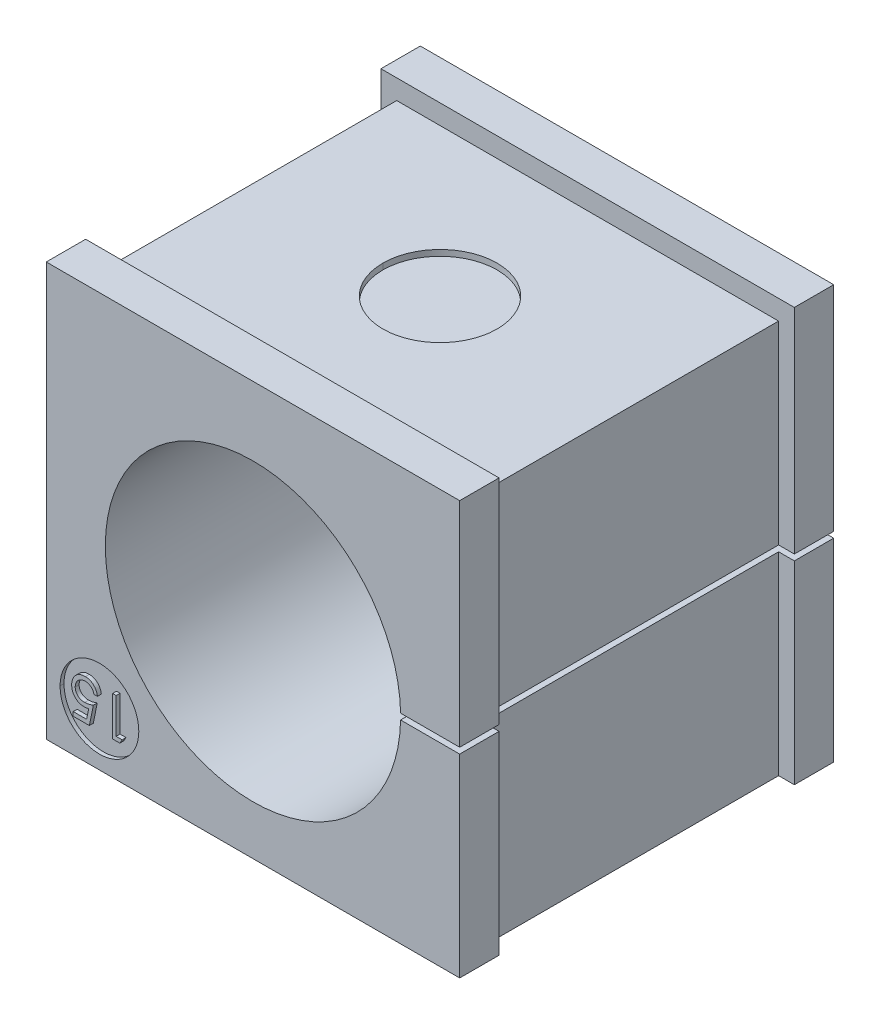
ISO-10303-21;
HEADER;
FILE_DESCRIPTION(('STEP AP214'),'2;1');
FILE_NAME('part.step','',(''),(''),'','','');
FILE_SCHEMA(('AUTOMOTIVE_DESIGN { 1 0 10303 214 1 1 1 1 }'));
ENDSEC;
DATA;
#1=APPLICATION_CONTEXT('core data for automotive mechanical design processes');
#2=APPLICATION_PROTOCOL_DEFINITION('international standard','automotive_design',2000,#1);
#3=PRODUCT_CONTEXT('',#1,'mechanical');
#4=PRODUCT('Part','Part','',(#3));
#5=PRODUCT_RELATED_PRODUCT_CATEGORY('part','',(#4));
#6=PRODUCT_DEFINITION_FORMATION('','',#4);
#7=PRODUCT_DEFINITION_CONTEXT('part definition',#1,'design');
#8=PRODUCT_DEFINITION('design','',#6,#7);
#9=PRODUCT_DEFINITION_SHAPE('','',#8);
#10=(LENGTH_UNIT() NAMED_UNIT(*) SI_UNIT(.MILLI.,.METRE.));
#11=(NAMED_UNIT(*) PLANE_ANGLE_UNIT() SI_UNIT($,.RADIAN.));
#12=(NAMED_UNIT(*) SI_UNIT($,.STERADIAN.) SOLID_ANGLE_UNIT());
#13=UNCERTAINTY_MEASURE_WITH_UNIT(LENGTH_MEASURE(1.E-05),#10,'distance_accuracy_value','');
#14=(GEOMETRIC_REPRESENTATION_CONTEXT(3) GLOBAL_UNCERTAINTY_ASSIGNED_CONTEXT((#13)) GLOBAL_UNIT_ASSIGNED_CONTEXT((#10,
#11,#12)) REPRESENTATION_CONTEXT('',''));
#15=CARTESIAN_POINT('',(0.,0.,0.));
#16=DIRECTION('',(0.,0.,1.));
#17=DIRECTION('',(1.,0.,0.));
#18=AXIS2_PLACEMENT_3D('',#15,#16,#17);
#19=CARTESIAN_POINT('',(2.0382977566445,-8.09673126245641,9.5));
#20=DIRECTION('',(-8.1972736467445E-13,3.26594258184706E-12,1.));
#21=DIRECTION('',(0.,-1.,3.26594258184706E-12));
#22=AXIS2_PLACEMENT_3D('',#19,#20,#21);
#23=PLANE('',#22);
#24=DIRECTION('',(-1.,0.,0.));
#25=VECTOR('',#24,1.);
#26=CARTESIAN_POINT('',(2.18717948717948,-8.8,9.5));
#27=LINE('',#26,#25);
#28=CARTESIAN_POINT('',(2.18717948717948,-8.8,9.5));
#29=VERTEX_POINT('',#28);
#30=CARTESIAN_POINT('',(1.36666666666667,-8.8,9.5));
#31=VERTEX_POINT('',#30);
#32=EDGE_CURVE('E588',#29,#31,#27,.T.);
#33=ORIENTED_EDGE('',*,*,#32,.F.);
#34=DIRECTION('',(-0.200944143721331,-0.97960270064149,0.));
#35=VECTOR('',#34,1.);
#36=CARTESIAN_POINT('',(2.39230769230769,-7.8,9.5));
#37=LINE('',#36,#35);
#38=CARTESIAN_POINT('',(2.39230769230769,-7.8,9.5));
#39=VERTEX_POINT('',#38);
#40=EDGE_CURVE('E357',#39,#29,#37,.T.);
#41=ORIENTED_EDGE('',*,*,#40,.F.);
#42=CARTESIAN_POINT('',(1.95160256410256,-7.9025641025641,9.5));
#43=CARTESIAN_POINT('',(1.96723943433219,-7.90224360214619,9.5));
#44=CARTESIAN_POINT('',(1.9992505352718,-7.90158748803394,9.5));
#45=CARTESIAN_POINT('',(2.04846754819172,-7.89642400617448,9.5));
#46=CARTESIAN_POINT('',(2.09996217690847,-7.88848048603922,9.5));
#47=CARTESIAN_POINT('',(2.15393433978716,-7.87703133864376,9.5));
#48=CARTESIAN_POINT('',(2.21023591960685,-7.86269621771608,9.5));
#49=CARTESIAN_POINT('',(2.26896054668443,-7.84479344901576,9.5));
#50=CARTESIAN_POINT('',(2.33010963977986,-7.82417171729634,9.5));
#51=CARTESIAN_POINT('',(2.37126735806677,-7.80817679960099,9.5));
#52=CARTESIAN_POINT('',(2.39230769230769,-7.8,9.5));
#53=(BOUNDED_CURVE() B_SPLINE_CURVE(3,(#42,#43,#44,#45,#46,#47,#48,#49,#50,#51,#52),
.UNSPECIFIED.,.F.,.F.) B_SPLINE_CURVE_WITH_KNOTS((4,1,1,1,1,1,1,1,4),(0.,0.103079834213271,
0.211020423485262,0.32596321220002,0.446499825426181,0.574634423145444,0.70889989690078,
0.851186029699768,1.),
.UNSPECIFIED.) CURVE() GEOMETRIC_REPRESENTATION_ITEM() RATIONAL_B_SPLINE_CURVE((1.,1.,1.,1.,1.,
1.,1.,1.,1.,1.,1.)) REPRESENTATION_ITEM(''));
#54=CARTESIAN_POINT('',(1.95160256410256,-7.9025641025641,9.5));
#55=VERTEX_POINT('',#54);
#56=EDGE_CURVE('E339',#55,#39,#53,.T.);
#57=ORIENTED_EDGE('',*,*,#56,.F.);
#58=CARTESIAN_POINT('',(1.46923076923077,-7.46105769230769,9.5));
#59=CARTESIAN_POINT('',(1.46953466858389,-7.47711260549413,9.5));
#60=CARTESIAN_POINT('',(1.47012734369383,-7.50842345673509,9.5));
#61=CARTESIAN_POINT('',(1.47713648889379,-7.55418974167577,9.5));
#62=CARTESIAN_POINT('',(1.48657725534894,-7.59787618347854,9.5));
#63=CARTESIAN_POINT('',(1.50146704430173,-7.63907460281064,9.5));
#64=CARTESIAN_POINT('',(1.51955279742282,-7.67821511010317,9.5));
#65=CARTESIAN_POINT('',(1.54311778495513,-7.71433058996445,9.5));
#66=CARTESIAN_POINT('',(1.56917040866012,-7.74918694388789,9.5));
#67=CARTESIAN_POINT('',(1.60037020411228,-7.78047975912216,9.5));
#68=CARTESIAN_POINT('',(1.63415239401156,-7.8096029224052,9.5));
#69=CARTESIAN_POINT('',(1.67158915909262,-7.83430346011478,9.5));
#70=CARTESIAN_POINT('',(1.71161063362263,-7.85531901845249,9.5));
#71=CARTESIAN_POINT('',(1.75431008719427,-7.87253498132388,9.5));
#72=CARTESIAN_POINT('',(1.79973491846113,-7.88624951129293,9.5));
#73=CARTESIAN_POINT('',(1.84791103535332,-7.89572763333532,9.5));
#74=CARTESIAN_POINT('',(1.89884901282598,-7.90139924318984,9.5));
#75=CARTESIAN_POINT('',(1.93369224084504,-7.90216862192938,9.5));
#76=CARTESIAN_POINT('',(1.95160256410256,-7.9025641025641,9.5));
#77=(BOUNDED_CURVE() B_SPLINE_CURVE(3,(#58,#59,#60,#61,#62,#63,#64,#65,#66,#67,#68,#69,#70,#71,
#72,#73,#74,#75,#76),.UNSPECIFIED.,.F.,.F.) B_SPLINE_CURVE_WITH_KNOTS((4,1,1,1,1,1,1,1,1,1,1,1,
1,1,1,1,4),(0.,0.0653638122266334,0.127474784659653,0.188335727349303,0.247202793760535,
0.305627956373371,0.363605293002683,0.422603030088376,0.482640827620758,0.543265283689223,
0.604094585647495,0.664953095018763,0.727206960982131,0.791427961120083,0.858028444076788,
0.927022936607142,1.),
.UNSPECIFIED.) CURVE() GEOMETRIC_REPRESENTATION_ITEM() RATIONAL_B_SPLINE_CURVE((1.,1.,1.,1.,1.,
1.,1.,1.,1.,1.,1.,1.,1.,1.,1.,1.,1.,1.,1.)) REPRESENTATION_ITEM(''));
#78=CARTESIAN_POINT('',(1.46923076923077,-7.46105769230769,9.5));
#79=VERTEX_POINT('',#78);
#80=EDGE_CURVE('E345',#79,#55,#77,.T.);
#81=ORIENTED_EDGE('',*,*,#80,.F.);
#82=CARTESIAN_POINT('',(1.97684294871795,-6.95384615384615,9.5));
#83=CARTESIAN_POINT('',(1.95972528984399,-6.95431909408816,9.5));
#84=CARTESIAN_POINT('',(1.92602047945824,-6.95525031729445,9.5));
#85=CARTESIAN_POINT('',(1.87639314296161,-6.96230203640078,9.5));
#86=CARTESIAN_POINT('',(1.82861985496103,-6.9734477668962,9.5));
#87=CARTESIAN_POINT('',(1.78261581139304,-6.98906229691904,9.5));
#88=CARTESIAN_POINT('',(1.73860706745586,-7.00971940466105,9.5));
#89=CARTESIAN_POINT('',(1.69665584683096,-7.03509547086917,9.5));
#90=CARTESIAN_POINT('',(1.65616451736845,-7.06455738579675,9.5));
#91=CARTESIAN_POINT('',(1.61819874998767,-7.09823127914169,9.5));
#92=CARTESIAN_POINT('',(1.58343518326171,-7.13536100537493,9.5));
#93=CARTESIAN_POINT('',(1.55271692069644,-7.17506127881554,9.5));
#94=CARTESIAN_POINT('',(1.52713023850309,-7.21741404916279,9.5));
#95=CARTESIAN_POINT('',(1.50556785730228,-7.26168434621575,9.5));
#96=CARTESIAN_POINT('',(1.48919455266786,-7.30835782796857,9.5));
#97=CARTESIAN_POINT('',(1.47751398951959,-7.3572156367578,9.5));
#98=CARTESIAN_POINT('',(1.47065509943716,-7.40837848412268,9.5));
#99=CARTESIAN_POINT('',(1.4697115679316,-7.4432752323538,9.5));
#100=CARTESIAN_POINT('',(1.46923076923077,-7.46105769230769,9.5));
#101=(BOUNDED_CURVE() B_SPLINE_CURVE(3,(#82,#83,#84,#85,#86,#87,#88,#89,#90,#91,#92,#93,#94,#95,
#96,#97,#98,#99,#100),.UNSPECIFIED.,.F.,.F.) B_SPLINE_CURVE_WITH_KNOTS((4,1,1,1,1,1,1,1,1,1,1,1,
1,1,1,1,4),(0.,0.0642043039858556,0.126418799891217,0.187671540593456,0.248040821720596,
0.30833728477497,0.369690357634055,0.431725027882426,0.495970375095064,0.559778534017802,
0.622313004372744,0.683925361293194,0.745104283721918,0.80674922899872,0.86909271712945,
0.933293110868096,1.),
.UNSPECIFIED.) CURVE() GEOMETRIC_REPRESENTATION_ITEM() RATIONAL_B_SPLINE_CURVE((1.,1.,1.,1.,1.,
1.,1.,1.,1.,1.,1.,1.,1.,1.,1.,1.,1.,1.,1.)) REPRESENTATION_ITEM(''));
#102=CARTESIAN_POINT('',(1.97684294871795,-6.95384615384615,9.5));
#103=VERTEX_POINT('',#102);
#104=EDGE_CURVE('E423',#103,#79,#101,.T.);
#105=ORIENTED_EDGE('',*,*,#104,.F.);
#106=CARTESIAN_POINT('',(2.41794871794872,-7.31282051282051,9.5));
#107=CARTESIAN_POINT('',(2.41353794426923,-7.29374442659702,9.5));
#108=CARTESIAN_POINT('',(2.405060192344,-7.25707912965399,9.5));
#109=CARTESIAN_POINT('',(2.38635454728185,-7.20562644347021,9.5));
#110=CARTESIAN_POINT('',(2.36384547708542,-7.15958520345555,9.5));
#111=CARTESIAN_POINT('',(2.33583879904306,-7.11924495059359,9.5));
#112=CARTESIAN_POINT('',(2.30402621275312,-7.08324782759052,9.5));
#113=CARTESIAN_POINT('',(2.26730933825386,-7.05123655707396,9.5));
#114=CARTESIAN_POINT('',(2.22600019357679,-7.02270508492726,9.5));
#115=CARTESIAN_POINT('',(2.18008955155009,-6.99872836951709,9.5));
#116=CARTESIAN_POINT('',(2.13153029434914,-6.97856105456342,9.5));
#117=CARTESIAN_POINT('',(2.08100442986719,-6.96416180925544,9.5));
#118=CARTESIAN_POINT('',(2.02922940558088,-6.9554473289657,9.5));
#119=CARTESIAN_POINT('',(1.99437082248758,-6.95438188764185,9.5));
#120=CARTESIAN_POINT('',(1.97684294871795,-6.95384615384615,9.5));
#121=(BOUNDED_CURVE() B_SPLINE_CURVE(3,(#106,#107,#108,#109,#110,#111,#112,#113,#114,#115,#116,
#117,#118,#119,#120),.UNSPECIFIED.,.F.,.F.) B_SPLINE_CURVE_WITH_KNOTS((4,1,1,1,1,1,1,1,1,1,1,1,
4),(0.,0.0946975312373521,0.182013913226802,0.264405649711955,0.342044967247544,
0.418973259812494,0.496386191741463,0.577254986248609,0.661405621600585,0.746636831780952,
0.831346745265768,0.915196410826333,1.),
.UNSPECIFIED.) CURVE() GEOMETRIC_REPRESENTATION_ITEM() RATIONAL_B_SPLINE_CURVE((1.,1.,1.,1.,1.,
1.,1.,1.,1.,1.,1.,1.,1.,1.,1.)) REPRESENTATION_ITEM(''));
#122=CARTESIAN_POINT('',(2.41794871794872,-7.31282051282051,9.5));
#123=VERTEX_POINT('',#122);
#124=EDGE_CURVE('E500',#123,#103,#121,.T.);
#125=ORIENTED_EDGE('',*,*,#124,.F.);
#126=DIRECTION('',(-1.,0.,0.));
#127=VECTOR('',#126,1.);
#128=CARTESIAN_POINT('',(2.59743589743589,-7.31282051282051,9.5));
#129=LINE('',#128,#127);
#130=CARTESIAN_POINT('',(2.59743589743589,-7.31282051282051,9.5));
#131=VERTEX_POINT('',#130);
#132=EDGE_CURVE('E499',#131,#123,#129,.T.);
#133=ORIENTED_EDGE('',*,*,#132,.F.);
#134=CARTESIAN_POINT('',(1.98725961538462,-6.74871794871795,9.5));
#135=CARTESIAN_POINT('',(2.00718718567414,-6.74911380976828,9.5));
#136=CARTESIAN_POINT('',(2.04639232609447,-6.74989261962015,9.5));
#137=CARTESIAN_POINT('',(2.10384024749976,-6.75800183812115,9.5));
#138=CARTESIAN_POINT('',(2.15907799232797,-6.76969544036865,9.5));
#139=CARTESIAN_POINT('',(2.21187646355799,-6.78701084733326,9.5));
#140=CARTESIAN_POINT('',(2.26198736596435,-6.80971721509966,9.5));
#141=CARTESIAN_POINT('',(2.31013760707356,-6.83652227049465,9.5));
#142=CARTESIAN_POINT('',(2.355445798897,-6.86887491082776,9.5));
#143=CARTESIAN_POINT('',(2.3982333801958,-6.90561530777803,9.5));
#144=CARTESIAN_POINT('',(2.43748376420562,-6.94636501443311,9.5));
#145=CARTESIAN_POINT('',(2.47361816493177,-6.98968808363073,9.5));
#146=CARTESIAN_POINT('',(2.50490602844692,-7.03654540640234,9.5));
#147=CARTESIAN_POINT('',(2.53209209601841,-7.08615525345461,9.5));
#148=CARTESIAN_POINT('',(2.55521865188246,-7.13864695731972,9.5));
#149=CARTESIAN_POINT('',(2.57340282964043,-7.19414235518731,9.5));
#150=CARTESIAN_POINT('',(2.58807502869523,-7.25237187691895,9.5));
#151=CARTESIAN_POINT('',(2.59428285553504,-7.29245946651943,9.5));
#152=CARTESIAN_POINT('',(2.59743589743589,-7.31282051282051,9.5));
#153=(BOUNDED_CURVE() B_SPLINE_CURVE(3,(#134,#135,#136,#137,#138,#139,#140,#141,#142,#143,#144,
#145,#146,#147,#148,#149,#150,#151,#152),.UNSPECIFIED.,.F.,.F.) B_SPLINE_CURVE_WITH_KNOTS((4,1,
1,1,1,1,1,1,1,1,1,1,1,1,1,1,4),(0.,0.0654348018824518,0.128735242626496,0.190275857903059,
0.250776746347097,0.310880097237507,0.370805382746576,0.431558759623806,0.493479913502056,
0.555853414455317,0.617262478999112,0.678600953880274,0.740657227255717,0.802944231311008,
0.866774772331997,0.93233304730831,1.),
.UNSPECIFIED.) CURVE() GEOMETRIC_REPRESENTATION_ITEM() RATIONAL_B_SPLINE_CURVE((1.,1.,1.,1.,1.,
1.,1.,1.,1.,1.,1.,1.,1.,1.,1.,1.,1.,1.,1.)) REPRESENTATION_ITEM(''));
#154=CARTESIAN_POINT('',(1.98725961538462,-6.74871794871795,9.5));
#155=VERTEX_POINT('',#154);
#156=EDGE_CURVE('E727',#155,#131,#153,.T.);
#157=ORIENTED_EDGE('',*,*,#156,.F.);
#158=CARTESIAN_POINT('',(1.28974358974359,-7.45344551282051,9.5));
#159=CARTESIAN_POINT('',(1.29012392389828,-7.43714718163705,9.5));
#160=CARTESIAN_POINT('',(1.29087945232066,-7.40477077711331,9.5));
#161=CARTESIAN_POINT('',(1.29471437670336,-7.35668719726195,9.5));
#162=CARTESIAN_POINT('',(1.30212209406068,-7.30962710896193,9.5));
#163=CARTESIAN_POINT('',(1.31196100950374,-7.26368372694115,9.5));
#164=CARTESIAN_POINT('',(1.32504399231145,-7.21878848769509,9.5));
#165=CARTESIAN_POINT('',(1.34051526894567,-7.17483546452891,9.5));
#166=CARTESIAN_POINT('',(1.3590333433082,-7.13189737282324,9.5));
#167=CARTESIAN_POINT('',(1.38016500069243,-7.09018786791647,9.5));
#168=CARTESIAN_POINT('',(1.40420728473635,-7.05052789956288,9.5));
#169=CARTESIAN_POINT('',(1.42986580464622,-7.01245534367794,9.5));
#170=CARTESIAN_POINT('',(1.45782468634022,-6.97707472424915,9.5));
#171=CARTESIAN_POINT('',(1.4875944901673,-6.9437946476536,9.5));
#172=CARTESIAN_POINT('',(1.51974682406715,-6.91357230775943,9.5));
#173=CARTESIAN_POINT('',(1.55349266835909,-6.88514696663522,9.5));
#174=CARTESIAN_POINT('',(1.58958664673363,-6.8597243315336,9.5));
#175=CARTESIAN_POINT('',(1.62739245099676,-6.8363428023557,9.5));
#176=CARTESIAN_POINT('',(1.6668835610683,-6.8154074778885,9.5));
#177=CARTESIAN_POINT('',(1.70846113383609,-6.79794378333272,9.5));
#178=CARTESIAN_POINT('',(1.75121223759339,-6.78263667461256,9.5));
#179=CARTESIAN_POINT('',(1.79551796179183,-6.77018886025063,9.5));
#180=CARTESIAN_POINT('',(1.84129245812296,-6.76053115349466,9.5));
#181=CARTESIAN_POINT('',(1.88869335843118,-6.75395438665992,9.5));
#182=CARTESIAN_POINT('',(1.9374828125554,-6.74916921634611,9.5));
#183=CARTESIAN_POINT('',(1.97055418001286,-6.74886939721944,9.5));
#184=CARTESIAN_POINT('',(1.98725961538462,-6.74871794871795,9.5));
#185=(BOUNDED_CURVE() B_SPLINE_CURVE(3,(#158,#159,#160,#161,#162,#163,#164,#165,#166,#167,#168,
#169,#170,#171,#172,#173,#174,#175,#176,#177,#178,#179,#180,#181,#182,#183,#184),.UNSPECIFIED.,
.F.,.F.) B_SPLINE_CURVE_WITH_KNOTS((4,1,1,1,1,1,1,1,1,1,1,1,1,1,1,1,1,1,1,1,1,1,1,1,4),(0.,
0.0440117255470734,0.0874286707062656,0.130110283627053,0.172542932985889,0.214194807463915,
0.256275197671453,0.298268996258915,0.340355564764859,0.382403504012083,0.42340579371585,
0.464231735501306,0.504056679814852,0.543842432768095,0.583267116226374,0.623085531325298,
0.662910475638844,0.70323015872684,0.743614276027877,0.784554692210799,0.825760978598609,
0.867765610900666,0.910750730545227,0.954917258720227,1.),
.UNSPECIFIED.) CURVE() GEOMETRIC_REPRESENTATION_ITEM() RATIONAL_B_SPLINE_CURVE((1.,1.,1.,1.,1.,
1.,1.,1.,1.,1.,1.,1.,1.,1.,1.,1.,1.,1.,1.,1.,1.,1.,1.,1.,1.,1.,1.)) REPRESENTATION_ITEM(''));
#186=CARTESIAN_POINT('',(1.28974358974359,-7.45344551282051,9.5));
#187=VERTEX_POINT('',#186);
#188=EDGE_CURVE('E571',#187,#155,#185,.T.);
#189=ORIENTED_EDGE('',*,*,#188,.F.);
#190=CARTESIAN_POINT('',(1.91915064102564,-8.10769230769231,9.5));
#191=CARTESIAN_POINT('',(1.89681305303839,-8.10722475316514,9.5));
#192=CARTESIAN_POINT('',(1.85289177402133,-8.10630542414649,9.5));
#193=CARTESIAN_POINT('',(1.78872821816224,-8.09695798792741,9.5));
#194=CARTESIAN_POINT('',(1.72717371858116,-8.08340984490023,9.5));
#195=CARTESIAN_POINT('',(1.66911365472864,-8.06257021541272,9.5));
#196=CARTESIAN_POINT('',(1.61361197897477,-8.03695729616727,9.5));
#197=CARTESIAN_POINT('',(1.56142115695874,-8.00511597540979,9.5));
#198=CARTESIAN_POINT('',(1.51229602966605,-7.96749997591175,9.5));
#199=CARTESIAN_POINT('',(1.46634397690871,-7.92488094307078,9.5));
#200=CARTESIAN_POINT('',(1.42491658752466,-7.87742931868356,9.5));
#201=CARTESIAN_POINT('',(1.38877341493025,-7.82636713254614,9.5));
#202=CARTESIAN_POINT('',(1.35787966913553,-7.77226416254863,9.5));
#203=CARTESIAN_POINT('',(1.33323560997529,-7.71462275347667,9.5));
#204=CARTESIAN_POINT('',(1.31325466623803,-7.65398611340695,9.5));
#205=CARTESIAN_POINT('',(1.30004324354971,-7.58984543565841,9.5));
#206=CARTESIAN_POINT('',(1.29122863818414,-7.5227343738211,9.5));
#207=CARTESIAN_POINT('',(1.29024512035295,-7.47684574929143,9.5));
#208=CARTESIAN_POINT('',(1.28974358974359,-7.45344551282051,9.5));
#209=(BOUNDED_CURVE() B_SPLINE_CURVE(3,(#190,#191,#192,#193,#194,#195,#196,#197,#198,#199,#200,
#201,#202,#203,#204,#205,#206,#207,#208),.UNSPECIFIED.,.F.,.F.) B_SPLINE_CURVE_WITH_KNOTS((4,1,
1,1,1,1,1,1,1,1,1,1,1,1,1,1,4),(0.,0.0657910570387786,0.129361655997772,0.190756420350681,
0.251257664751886,0.310776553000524,0.370653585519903,0.431035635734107,0.49286417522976,
0.555071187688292,0.616339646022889,0.6769764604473,0.738325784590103,0.800812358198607,
0.864811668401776,0.93106267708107,1.),
.UNSPECIFIED.) CURVE() GEOMETRIC_REPRESENTATION_ITEM() RATIONAL_B_SPLINE_CURVE((1.,1.,1.,1.,1.,
1.,1.,1.,1.,1.,1.,1.,1.,1.,1.,1.,1.,1.,1.)) REPRESENTATION_ITEM(''));
#210=CARTESIAN_POINT('',(1.91915064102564,-8.10769230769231,9.5));
#211=VERTEX_POINT('',#210);
#212=EDGE_CURVE('E471',#211,#187,#209,.T.);
#213=ORIENTED_EDGE('',*,*,#212,.F.);
#214=CARTESIAN_POINT('',(2.15472756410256,-8.06883012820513,9.5));
#215=CARTESIAN_POINT('',(2.13355277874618,-8.07467599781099,9.5));
#216=CARTESIAN_POINT('',(2.09252998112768,-8.08600144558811,9.5));
#217=CARTESIAN_POINT('',(2.03198148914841,-8.09857617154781,9.5));
#218=CARTESIAN_POINT('',(1.97450023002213,-8.10615642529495,9.5));
#219=CARTESIAN_POINT('',(1.93720001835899,-8.10719145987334,9.5));
#220=CARTESIAN_POINT('',(1.91915064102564,-8.10769230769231,9.5));
#221=(BOUNDED_CURVE() B_SPLINE_CURVE(3,(#214,#215,#216,#217,#218,#219,#220),.UNSPECIFIED.,.F.,
.F.) B_SPLINE_CURVE_WITH_KNOTS((4,1,1,1,4),(0.,0.275068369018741,0.532901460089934,
0.773973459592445,1.),
.UNSPECIFIED.) CURVE() GEOMETRIC_REPRESENTATION_ITEM() RATIONAL_B_SPLINE_CURVE((1.,1.,1.,1.,1.,
1.,1.)) REPRESENTATION_ITEM(''));
#222=CARTESIAN_POINT('',(2.15472756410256,-8.06883012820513,9.5));
#223=VERTEX_POINT('',#222);
#224=EDGE_CURVE('E75',#223,#211,#221,.T.);
#225=ORIENTED_EDGE('',*,*,#224,.F.);
#226=DIRECTION('',(0.200705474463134,0.979651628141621,0.));
#227=VECTOR('',#226,1.);
#228=CARTESIAN_POINT('',(2.04695512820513,-8.59487179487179,9.5));
#229=LINE('',#228,#227);
#230=CARTESIAN_POINT('',(2.04695512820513,-8.59487179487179,9.5));
#231=VERTEX_POINT('',#230);
#232=EDGE_CURVE('E65',#231,#223,#229,.T.);
#233=ORIENTED_EDGE('',*,*,#232,.F.);
#234=DIRECTION('',(1.,0.,0.));
#235=VECTOR('',#234,1.);
#236=CARTESIAN_POINT('',(1.36666666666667,-8.59487179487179,9.5));
#237=LINE('',#236,#235);
#238=CARTESIAN_POINT('',(1.36666666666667,-8.59487179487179,9.5));
#239=VERTEX_POINT('',#238);
#240=EDGE_CURVE('E24',#239,#231,#237,.T.);
#241=ORIENTED_EDGE('',*,*,#240,.F.);
#242=DIRECTION('',(0.,1.,0.));
#243=VECTOR('',#242,1.);
#244=CARTESIAN_POINT('',(1.36666666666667,-8.8,9.5));
#245=LINE('',#244,#243);
#246=EDGE_CURVE('E9',#31,#239,#245,.T.);
#247=ORIENTED_EDGE('',*,*,#246,.F.);
#248=EDGE_LOOP('',(#33,#41,#57,#81,#105,#125,#133,#157,#189,#213,#225,#233,#241,#247));
#249=FACE_BOUND('',#248,.T.);
#250=ADVANCED_FACE('F15',(#249),#23,.T.);
#251=CARTESIAN_POINT('',(1.36666666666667,-8.8,9.5));
#252=DIRECTION('',(-1.,0.,0.));
#253=DIRECTION('',(0.,0.,1.));
#254=AXIS2_PLACEMENT_3D('',#251,#252,#253);
#255=PLANE('',#254);
#256=DIRECTION('',(0.,1.,0.));
#257=VECTOR('',#256,1.);
#258=CARTESIAN_POINT('',(1.36666666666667,-8.8,9.3));
#259=LINE('',#258,#257);
#260=CARTESIAN_POINT('',(1.36666666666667,-8.8,9.3));
#261=VERTEX_POINT('',#260);
#262=CARTESIAN_POINT('',(1.36666666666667,-8.59487179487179,9.3));
#263=VERTEX_POINT('',#262);
#264=EDGE_CURVE('E580',#261,#263,#259,.T.);
#265=ORIENTED_EDGE('',*,*,#264,.F.);
#266=DIRECTION('',(0.,0.,-1.));
#267=VECTOR('',#266,1.);
#268=CARTESIAN_POINT('',(1.36666666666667,-8.8,9.5));
#269=LINE('',#268,#267);
#270=EDGE_CURVE('E395',#31,#261,#269,.T.);
#271=ORIENTED_EDGE('',*,*,#270,.F.);
#272=ORIENTED_EDGE('',*,*,#246,.T.);
#273=DIRECTION('',(0.,0.,-1.));
#274=VECTOR('',#273,1.);
#275=CARTESIAN_POINT('',(1.36666666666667,-8.59487179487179,9.5));
#276=LINE('',#275,#274);
#277=EDGE_CURVE('E752',#239,#263,#276,.T.);
#278=ORIENTED_EDGE('',*,*,#277,.T.);
#279=EDGE_LOOP('',(#265,#271,#272,#278));
#280=FACE_BOUND('',#279,.T.);
#281=ADVANCED_FACE('F1006',(#280),#255,.T.);
#282=CARTESIAN_POINT('',(1.36666666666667,-8.59487179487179,9.5));
#283=DIRECTION('',(0.,1.,0.));
#284=DIRECTION('',(1.,0.,0.));
#285=AXIS2_PLACEMENT_3D('',#282,#283,#284);
#286=PLANE('',#285);
#287=DIRECTION('',(1.,0.,0.));
#288=VECTOR('',#287,1.);
#289=CARTESIAN_POINT('',(1.36666666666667,-8.59487179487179,9.3));
#290=LINE('',#289,#288);
#291=CARTESIAN_POINT('',(2.04695512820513,-8.59487179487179,9.3));
#292=VERTEX_POINT('',#291);
#293=EDGE_CURVE('E584',#263,#292,#290,.T.);
#294=ORIENTED_EDGE('',*,*,#293,.F.);
#295=ORIENTED_EDGE('',*,*,#277,.F.);
#296=ORIENTED_EDGE('',*,*,#240,.T.);
#297=DIRECTION('',(0.,0.,-1.));
#298=VECTOR('',#297,1.);
#299=CARTESIAN_POINT('',(2.04695512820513,-8.59487179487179,9.5));
#300=LINE('',#299,#298);
#301=EDGE_CURVE('E746',#231,#292,#300,.T.);
#302=ORIENTED_EDGE('',*,*,#301,.T.);
#303=EDGE_LOOP('',(#294,#295,#296,#302));
#304=FACE_BOUND('',#303,.T.);
#305=ADVANCED_FACE('F758',(#304),#286,.T.);
#306=CARTESIAN_POINT('',(2.04695512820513,-8.59487179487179,9.5));
#307=DIRECTION('',(-0.979651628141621,0.200705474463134,0.));
#308=DIRECTION('',(0.,0.,1.));
#309=AXIS2_PLACEMENT_3D('',#306,#307,#308);
#310=PLANE('',#309);
#311=DIRECTION('',(0.200705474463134,0.979651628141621,0.));
#312=VECTOR('',#311,1.);
#313=CARTESIAN_POINT('',(2.04695512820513,-8.59487179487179,9.3));
#314=LINE('',#313,#312);
#315=CARTESIAN_POINT('',(2.15472756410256,-8.06883012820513,9.3));
#316=VERTEX_POINT('',#315);
#317=EDGE_CURVE('E590',#292,#316,#314,.T.);
#318=ORIENTED_EDGE('',*,*,#317,.F.);
#319=ORIENTED_EDGE('',*,*,#301,.F.);
#320=ORIENTED_EDGE('',*,*,#232,.T.);
#321=DIRECTION('',(0.,0.,-1.));
#322=VECTOR('',#321,1.);
#323=CARTESIAN_POINT('',(2.15472756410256,-8.06883012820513,9.5));
#324=LINE('',#323,#322);
#325=EDGE_CURVE('E468',#223,#316,#324,.T.);
#326=ORIENTED_EDGE('',*,*,#325,.T.);
#327=EDGE_LOOP('',(#318,#319,#320,#326));
#328=FACE_BOUND('',#327,.T.);
#329=ADVANCED_FACE('F760',(#328),#310,.T.);
#330=CARTESIAN_POINT('',(2.15472756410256,-8.06883012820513,9.5));
#331=CARTESIAN_POINT('',(2.15472756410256,-8.06883012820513,9.3));
#332=CARTESIAN_POINT('',(2.13355277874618,-8.07467599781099,9.5));
#333=CARTESIAN_POINT('',(2.13355277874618,-8.07467599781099,9.3));
#334=CARTESIAN_POINT('',(2.09252998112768,-8.08600144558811,9.5));
#335=CARTESIAN_POINT('',(2.09252998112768,-8.08600144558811,9.3));
#336=CARTESIAN_POINT('',(2.03198148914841,-8.09857617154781,9.5));
#337=CARTESIAN_POINT('',(2.03198148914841,-8.09857617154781,9.3));
#338=CARTESIAN_POINT('',(1.97450023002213,-8.10615642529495,9.5));
#339=CARTESIAN_POINT('',(1.97450023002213,-8.10615642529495,9.3));
#340=CARTESIAN_POINT('',(1.93720001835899,-8.10719145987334,9.5));
#341=CARTESIAN_POINT('',(1.93720001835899,-8.10719145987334,9.3));
#342=CARTESIAN_POINT('',(1.91915064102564,-8.10769230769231,9.5));
#343=CARTESIAN_POINT('',(1.91915064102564,-8.10769230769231,9.3));
#344=(BOUNDED_SURFACE() B_SPLINE_SURFACE(3,1,((#330,#331),(#332,#333),(#334,#335),(#336,#337),
(#338,#339),(#340,#341),(#342,#343)),.UNSPECIFIED.,.F.,.F.,.F.) B_SPLINE_SURFACE_WITH_KNOTS((4,
1,1,1,4),(2,2),(0.,0.275068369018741,0.532901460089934,0.773973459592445,1.),(0.,1.),
.UNSPECIFIED.) GEOMETRIC_REPRESENTATION_ITEM() RATIONAL_B_SPLINE_SURFACE(((1.,1.),(1.,1.),(1.,
1.),(1.,1.),(1.,1.),(1.,1.),(1.,1.))) REPRESENTATION_ITEM('') SURFACE());
#345=CARTESIAN_POINT('',(2.15472756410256,-8.06883012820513,9.3));
#346=CARTESIAN_POINT('',(2.13355277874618,-8.07467599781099,9.3));
#347=CARTESIAN_POINT('',(2.09252998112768,-8.08600144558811,9.3));
#348=CARTESIAN_POINT('',(2.03198148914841,-8.09857617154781,9.3));
#349=CARTESIAN_POINT('',(1.97450023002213,-8.10615642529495,9.3));
#350=CARTESIAN_POINT('',(1.93720001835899,-8.10719145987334,9.3));
#351=CARTESIAN_POINT('',(1.91915064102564,-8.10769230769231,9.3));
#352=(BOUNDED_CURVE() B_SPLINE_CURVE(3,(#345,#346,#347,#348,#349,#350,#351),.UNSPECIFIED.,.F.,
.F.) B_SPLINE_CURVE_WITH_KNOTS((4,1,1,1,4),(0.,0.275068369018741,0.532901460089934,
0.773973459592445,1.),
.UNSPECIFIED.) CURVE() GEOMETRIC_REPRESENTATION_ITEM() RATIONAL_B_SPLINE_CURVE((1.,1.,1.,1.,1.,
1.,1.)) REPRESENTATION_ITEM(''));
#353=CARTESIAN_POINT('',(1.91915064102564,-8.10769230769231,9.3));
#354=VERTEX_POINT('',#353);
#355=EDGE_CURVE('E594',#316,#354,#352,.T.);
#356=DIRECTION('',(0.,0.,-1.));
#357=VECTOR('',#356,1.);
#358=CARTESIAN_POINT('',(1.91915064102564,-8.10769230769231,9.5));
#359=LINE('',#358,#357);
#360=EDGE_CURVE('E568',#211,#354,#359,.T.);
#361=ORIENTED_EDGE('',*,*,#355,.F.);
#362=ORIENTED_EDGE('',*,*,#325,.F.);
#363=ORIENTED_EDGE('',*,*,#224,.T.);
#364=ORIENTED_EDGE('',*,*,#360,.T.);
#365=EDGE_LOOP('',(#361,#362,#363,#364));
#366=FACE_BOUND('',#365,.T.);
#367=ADVANCED_FACE('F1063',(#366),#344,.T.);
#368=CARTESIAN_POINT('',(1.91915064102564,-8.10769230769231,9.5));
#369=CARTESIAN_POINT('',(1.91915064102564,-8.10769230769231,9.3));
#370=CARTESIAN_POINT('',(1.89681305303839,-8.10722475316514,9.5));
#371=CARTESIAN_POINT('',(1.89681305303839,-8.10722475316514,9.3));
#372=CARTESIAN_POINT('',(1.85289177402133,-8.10630542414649,9.5));
#373=CARTESIAN_POINT('',(1.85289177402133,-8.10630542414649,9.3));
#374=CARTESIAN_POINT('',(1.78872821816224,-8.09695798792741,9.5));
#375=CARTESIAN_POINT('',(1.78872821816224,-8.09695798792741,9.3));
#376=CARTESIAN_POINT('',(1.72717371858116,-8.08340984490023,9.5));
#377=CARTESIAN_POINT('',(1.72717371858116,-8.08340984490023,9.3));
#378=CARTESIAN_POINT('',(1.66911365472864,-8.06257021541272,9.5));
#379=CARTESIAN_POINT('',(1.66911365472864,-8.06257021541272,9.3));
#380=CARTESIAN_POINT('',(1.61361197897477,-8.03695729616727,9.5));
#381=CARTESIAN_POINT('',(1.61361197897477,-8.03695729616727,9.3));
#382=CARTESIAN_POINT('',(1.56142115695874,-8.00511597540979,9.5));
#383=CARTESIAN_POINT('',(1.56142115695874,-8.00511597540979,9.3));
#384=CARTESIAN_POINT('',(1.51229602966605,-7.96749997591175,9.5));
#385=CARTESIAN_POINT('',(1.51229602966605,-7.96749997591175,9.3));
#386=CARTESIAN_POINT('',(1.46634397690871,-7.92488094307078,9.5));
#387=CARTESIAN_POINT('',(1.46634397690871,-7.92488094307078,9.3));
#388=CARTESIAN_POINT('',(1.42491658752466,-7.87742931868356,9.5));
#389=CARTESIAN_POINT('',(1.42491658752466,-7.87742931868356,9.3));
#390=CARTESIAN_POINT('',(1.38877341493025,-7.82636713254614,9.5));
#391=CARTESIAN_POINT('',(1.38877341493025,-7.82636713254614,9.3));
#392=CARTESIAN_POINT('',(1.35787966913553,-7.77226416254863,9.5));
#393=CARTESIAN_POINT('',(1.35787966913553,-7.77226416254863,9.3));
#394=CARTESIAN_POINT('',(1.33323560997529,-7.71462275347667,9.5));
#395=CARTESIAN_POINT('',(1.33323560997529,-7.71462275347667,9.3));
#396=CARTESIAN_POINT('',(1.31325466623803,-7.65398611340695,9.5));
#397=CARTESIAN_POINT('',(1.31325466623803,-7.65398611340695,9.3));
#398=CARTESIAN_POINT('',(1.30004324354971,-7.58984543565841,9.5));
#399=CARTESIAN_POINT('',(1.30004324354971,-7.58984543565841,9.3));
#400=CARTESIAN_POINT('',(1.29122863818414,-7.5227343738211,9.5));
#401=CARTESIAN_POINT('',(1.29122863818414,-7.5227343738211,9.3));
#402=CARTESIAN_POINT('',(1.29024512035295,-7.47684574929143,9.5));
#403=CARTESIAN_POINT('',(1.29024512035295,-7.47684574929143,9.3));
#404=CARTESIAN_POINT('',(1.28974358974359,-7.45344551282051,9.5));
#405=CARTESIAN_POINT('',(1.28974358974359,-7.45344551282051,9.3));
#406=(BOUNDED_SURFACE() B_SPLINE_SURFACE(3,1,((#368,#369),(#370,#371),(#372,#373),(#374,#375),
(#376,#377),(#378,#379),(#380,#381),(#382,#383),(#384,#385),(#386,#387),(#388,#389),(#390,#391),
(#392,#393),(#394,#395),(#396,#397),(#398,#399),(#400,#401),(#402,#403),(#404,#405)),
.UNSPECIFIED.,.F.,.F.,.F.) B_SPLINE_SURFACE_WITH_KNOTS((4,1,1,1,1,1,1,1,1,1,1,1,1,1,1,1,4),(2,
2),(0.,0.0657910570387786,0.129361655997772,0.190756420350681,0.251257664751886,
0.310776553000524,0.370653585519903,0.431035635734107,0.49286417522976,0.555071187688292,
0.616339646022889,0.6769764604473,0.738325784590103,0.800812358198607,0.864811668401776,
0.93106267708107,1.),(0.,1.),
.UNSPECIFIED.) GEOMETRIC_REPRESENTATION_ITEM() RATIONAL_B_SPLINE_SURFACE(((1.,1.),(1.,1.),(1.,
1.),(1.,1.),(1.,1.),(1.,1.),(1.,1.),(1.,1.),(1.,1.),(1.,1.),(1.,1.),(1.,1.),(1.,1.),(1.,1.),(1.,
1.),(1.,1.),(1.,1.),(1.,1.),(1.,1.))) REPRESENTATION_ITEM('') SURFACE());
#407=CARTESIAN_POINT('',(1.91915064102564,-8.10769230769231,9.3));
#408=CARTESIAN_POINT('',(1.89681305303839,-8.10722475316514,9.3));
#409=CARTESIAN_POINT('',(1.85289177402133,-8.10630542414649,9.3));
#410=CARTESIAN_POINT('',(1.78872821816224,-8.09695798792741,9.3));
#411=CARTESIAN_POINT('',(1.72717371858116,-8.08340984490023,9.3));
#412=CARTESIAN_POINT('',(1.66911365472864,-8.06257021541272,9.3));
#413=CARTESIAN_POINT('',(1.61361197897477,-8.03695729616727,9.3));
#414=CARTESIAN_POINT('',(1.56142115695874,-8.00511597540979,9.3));
#415=CARTESIAN_POINT('',(1.51229602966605,-7.96749997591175,9.3));
#416=CARTESIAN_POINT('',(1.46634397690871,-7.92488094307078,9.3));
#417=CARTESIAN_POINT('',(1.42491658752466,-7.87742931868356,9.3));
#418=CARTESIAN_POINT('',(1.38877341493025,-7.82636713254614,9.3));
#419=CARTESIAN_POINT('',(1.35787966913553,-7.77226416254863,9.3));
#420=CARTESIAN_POINT('',(1.33323560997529,-7.71462275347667,9.3));
#421=CARTESIAN_POINT('',(1.31325466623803,-7.65398611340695,9.3));
#422=CARTESIAN_POINT('',(1.30004324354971,-7.58984543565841,9.3));
#423=CARTESIAN_POINT('',(1.29122863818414,-7.5227343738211,9.3));
#424=CARTESIAN_POINT('',(1.29024512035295,-7.47684574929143,9.3));
#425=CARTESIAN_POINT('',(1.28974358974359,-7.45344551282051,9.3));
#426=(BOUNDED_CURVE() B_SPLINE_CURVE(3,(#407,#408,#409,#410,#411,#412,#413,#414,#415,#416,#417,
#418,#419,#420,#421,#422,#423,#424,#425),.UNSPECIFIED.,.F.,.F.) B_SPLINE_CURVE_WITH_KNOTS((4,1,
1,1,1,1,1,1,1,1,1,1,1,1,1,1,4),(0.,0.0657910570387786,0.129361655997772,0.190756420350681,
0.251257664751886,0.310776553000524,0.370653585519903,0.431035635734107,0.49286417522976,
0.555071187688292,0.616339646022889,0.6769764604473,0.738325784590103,0.800812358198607,
0.864811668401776,0.93106267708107,1.),
.UNSPECIFIED.) CURVE() GEOMETRIC_REPRESENTATION_ITEM() RATIONAL_B_SPLINE_CURVE((1.,1.,1.,1.,1.,
1.,1.,1.,1.,1.,1.,1.,1.,1.,1.,1.,1.,1.,1.)) REPRESENTATION_ITEM(''));
#427=CARTESIAN_POINT('',(1.28974358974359,-7.45344551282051,9.3));
#428=VERTEX_POINT('',#427);
#429=EDGE_CURVE('E598',#354,#428,#426,.T.);
#430=DIRECTION('',(0.,0.,-1.));
#431=VECTOR('',#430,1.);
#432=CARTESIAN_POINT('',(1.28974358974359,-7.45344551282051,9.5));
#433=LINE('',#432,#431);
#434=EDGE_CURVE('E724',#187,#428,#433,.T.);
#435=ORIENTED_EDGE('',*,*,#429,.F.);
#436=ORIENTED_EDGE('',*,*,#360,.F.);
#437=ORIENTED_EDGE('',*,*,#212,.T.);
#438=ORIENTED_EDGE('',*,*,#434,.T.);
#439=EDGE_LOOP('',(#435,#436,#437,#438));
#440=FACE_BOUND('',#439,.T.);
#441=ADVANCED_FACE('F1053',(#440),#406,.T.);
#442=CARTESIAN_POINT('',(1.28974358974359,-7.45344551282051,9.5));
#443=CARTESIAN_POINT('',(1.28974358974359,-7.45344551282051,9.3));
#444=CARTESIAN_POINT('',(1.29012392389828,-7.43714718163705,9.5));
#445=CARTESIAN_POINT('',(1.29012392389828,-7.43714718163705,9.3));
#446=CARTESIAN_POINT('',(1.29087945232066,-7.40477077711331,9.5));
#447=CARTESIAN_POINT('',(1.29087945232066,-7.40477077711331,9.3));
#448=CARTESIAN_POINT('',(1.29471437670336,-7.35668719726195,9.5));
#449=CARTESIAN_POINT('',(1.29471437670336,-7.35668719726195,9.3));
#450=CARTESIAN_POINT('',(1.30212209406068,-7.30962710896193,9.5));
#451=CARTESIAN_POINT('',(1.30212209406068,-7.30962710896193,9.3));
#452=CARTESIAN_POINT('',(1.31196100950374,-7.26368372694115,9.5));
#453=CARTESIAN_POINT('',(1.31196100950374,-7.26368372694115,9.3));
#454=CARTESIAN_POINT('',(1.32504399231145,-7.21878848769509,9.5));
#455=CARTESIAN_POINT('',(1.32504399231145,-7.21878848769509,9.3));
#456=CARTESIAN_POINT('',(1.34051526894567,-7.17483546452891,9.5));
#457=CARTESIAN_POINT('',(1.34051526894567,-7.17483546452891,9.3));
#458=CARTESIAN_POINT('',(1.3590333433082,-7.13189737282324,9.5));
#459=CARTESIAN_POINT('',(1.3590333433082,-7.13189737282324,9.3));
#460=CARTESIAN_POINT('',(1.38016500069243,-7.09018786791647,9.5));
#461=CARTESIAN_POINT('',(1.38016500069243,-7.09018786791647,9.3));
#462=CARTESIAN_POINT('',(1.40420728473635,-7.05052789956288,9.5));
#463=CARTESIAN_POINT('',(1.40420728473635,-7.05052789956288,9.3));
#464=CARTESIAN_POINT('',(1.42986580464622,-7.01245534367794,9.5));
#465=CARTESIAN_POINT('',(1.42986580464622,-7.01245534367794,9.3));
#466=CARTESIAN_POINT('',(1.45782468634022,-6.97707472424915,9.5));
#467=CARTESIAN_POINT('',(1.45782468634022,-6.97707472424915,9.3));
#468=CARTESIAN_POINT('',(1.4875944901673,-6.9437946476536,9.5));
#469=CARTESIAN_POINT('',(1.4875944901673,-6.9437946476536,9.3));
#470=CARTESIAN_POINT('',(1.51974682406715,-6.91357230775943,9.5));
#471=CARTESIAN_POINT('',(1.51974682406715,-6.91357230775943,9.3));
#472=CARTESIAN_POINT('',(1.55349266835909,-6.88514696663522,9.5));
#473=CARTESIAN_POINT('',(1.55349266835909,-6.88514696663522,9.3));
#474=CARTESIAN_POINT('',(1.58958664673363,-6.8597243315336,9.5));
#475=CARTESIAN_POINT('',(1.58958664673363,-6.8597243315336,9.3));
#476=CARTESIAN_POINT('',(1.62739245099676,-6.8363428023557,9.5));
#477=CARTESIAN_POINT('',(1.62739245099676,-6.8363428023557,9.3));
#478=CARTESIAN_POINT('',(1.6668835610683,-6.8154074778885,9.5));
#479=CARTESIAN_POINT('',(1.6668835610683,-6.8154074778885,9.3));
#480=CARTESIAN_POINT('',(1.70846113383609,-6.79794378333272,9.5));
#481=CARTESIAN_POINT('',(1.70846113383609,-6.79794378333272,9.3));
#482=CARTESIAN_POINT('',(1.75121223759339,-6.78263667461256,9.5));
#483=CARTESIAN_POINT('',(1.75121223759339,-6.78263667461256,9.3));
#484=CARTESIAN_POINT('',(1.79551796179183,-6.77018886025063,9.5));
#485=CARTESIAN_POINT('',(1.79551796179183,-6.77018886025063,9.3));
#486=CARTESIAN_POINT('',(1.84129245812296,-6.76053115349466,9.5));
#487=CARTESIAN_POINT('',(1.84129245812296,-6.76053115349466,9.3));
#488=CARTESIAN_POINT('',(1.88869335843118,-6.75395438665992,9.5));
#489=CARTESIAN_POINT('',(1.88869335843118,-6.75395438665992,9.3));
#490=CARTESIAN_POINT('',(1.9374828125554,-6.74916921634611,9.5));
#491=CARTESIAN_POINT('',(1.9374828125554,-6.74916921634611,9.3));
#492=CARTESIAN_POINT('',(1.97055418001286,-6.74886939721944,9.5));
#493=CARTESIAN_POINT('',(1.97055418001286,-6.74886939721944,9.3));
#494=CARTESIAN_POINT('',(1.98725961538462,-6.74871794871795,9.5));
#495=CARTESIAN_POINT('',(1.98725961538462,-6.74871794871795,9.3));
#496=(BOUNDED_SURFACE() B_SPLINE_SURFACE(3,1,((#442,#443),(#444,#445),(#446,#447),(#448,#449),
(#450,#451),(#452,#453),(#454,#455),(#456,#457),(#458,#459),(#460,#461),(#462,#463),(#464,#465),
(#466,#467),(#468,#469),(#470,#471),(#472,#473),(#474,#475),(#476,#477),(#478,#479),(#480,#481),
(#482,#483),(#484,#485),(#486,#487),(#488,#489),(#490,#491),(#492,#493),(#494,#495)),
.UNSPECIFIED.,.F.,.F.,.F.) B_SPLINE_SURFACE_WITH_KNOTS((4,1,1,1,1,1,1,1,1,1,1,1,1,1,1,1,1,1,1,1,
1,1,1,1,4),(2,2),(0.,0.0440117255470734,0.0874286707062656,0.130110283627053,0.172542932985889,
0.214194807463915,0.256275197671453,0.298268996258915,0.340355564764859,0.382403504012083,
0.42340579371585,0.464231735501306,0.504056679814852,0.543842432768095,0.583267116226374,
0.623085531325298,0.662910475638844,0.70323015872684,0.743614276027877,0.784554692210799,
0.825760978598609,0.867765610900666,0.910750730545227,0.954917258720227,1.),(0.,1.),
.UNSPECIFIED.) GEOMETRIC_REPRESENTATION_ITEM() RATIONAL_B_SPLINE_SURFACE(((1.,1.),(1.,1.),(1.,
1.),(1.,1.),(1.,1.),(1.,1.),(1.,1.),(1.,1.),(1.,1.),(1.,1.),(1.,1.),(1.,1.),(1.,1.),(1.,1.),(1.,
1.),(1.,1.),(1.,1.),(1.,1.),(1.,1.),(1.,1.),(1.,1.),(1.,1.),(1.,1.),(1.,1.),(1.,1.),(1.,1.),(1.,1.))) REPRESENTATION_ITEM('') SURFACE());
#497=CARTESIAN_POINT('',(1.28974358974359,-7.45344551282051,9.3));
#498=CARTESIAN_POINT('',(1.29012392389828,-7.43714718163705,9.3));
#499=CARTESIAN_POINT('',(1.29087945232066,-7.40477077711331,9.3));
#500=CARTESIAN_POINT('',(1.29471437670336,-7.35668719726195,9.3));
#501=CARTESIAN_POINT('',(1.30212209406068,-7.30962710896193,9.3));
#502=CARTESIAN_POINT('',(1.31196100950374,-7.26368372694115,9.3));
#503=CARTESIAN_POINT('',(1.32504399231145,-7.21878848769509,9.3));
#504=CARTESIAN_POINT('',(1.34051526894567,-7.17483546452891,9.3));
#505=CARTESIAN_POINT('',(1.3590333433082,-7.13189737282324,9.3));
#506=CARTESIAN_POINT('',(1.38016500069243,-7.09018786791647,9.3));
#507=CARTESIAN_POINT('',(1.40420728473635,-7.05052789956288,9.3));
#508=CARTESIAN_POINT('',(1.42986580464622,-7.01245534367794,9.3));
#509=CARTESIAN_POINT('',(1.45782468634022,-6.97707472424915,9.3));
#510=CARTESIAN_POINT('',(1.4875944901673,-6.9437946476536,9.3));
#511=CARTESIAN_POINT('',(1.51974682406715,-6.91357230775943,9.3));
#512=CARTESIAN_POINT('',(1.55349266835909,-6.88514696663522,9.3));
#513=CARTESIAN_POINT('',(1.58958664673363,-6.8597243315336,9.3));
#514=CARTESIAN_POINT('',(1.62739245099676,-6.8363428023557,9.3));
#515=CARTESIAN_POINT('',(1.6668835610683,-6.8154074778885,9.3));
#516=CARTESIAN_POINT('',(1.70846113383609,-6.79794378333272,9.3));
#517=CARTESIAN_POINT('',(1.75121223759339,-6.78263667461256,9.3));
#518=CARTESIAN_POINT('',(1.79551796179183,-6.77018886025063,9.3));
#519=CARTESIAN_POINT('',(1.84129245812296,-6.76053115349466,9.3));
#520=CARTESIAN_POINT('',(1.88869335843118,-6.75395438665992,9.3));
#521=CARTESIAN_POINT('',(1.9374828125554,-6.74916921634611,9.3));
#522=CARTESIAN_POINT('',(1.97055418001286,-6.74886939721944,9.3));
#523=CARTESIAN_POINT('',(1.98725961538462,-6.74871794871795,9.3));
#524=(BOUNDED_CURVE() B_SPLINE_CURVE(3,(#497,#498,#499,#500,#501,#502,#503,#504,#505,#506,#507,
#508,#509,#510,#511,#512,#513,#514,#515,#516,#517,#518,#519,#520,#521,#522,#523),.UNSPECIFIED.,
.F.,.F.) B_SPLINE_CURVE_WITH_KNOTS((4,1,1,1,1,1,1,1,1,1,1,1,1,1,1,1,1,1,1,1,1,1,1,1,4),(0.,
0.0440117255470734,0.0874286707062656,0.130110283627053,0.172542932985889,0.214194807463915,
0.256275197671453,0.298268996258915,0.340355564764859,0.382403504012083,0.42340579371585,
0.464231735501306,0.504056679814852,0.543842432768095,0.583267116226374,0.623085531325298,
0.662910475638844,0.70323015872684,0.743614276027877,0.784554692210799,0.825760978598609,
0.867765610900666,0.910750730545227,0.954917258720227,1.),
.UNSPECIFIED.) CURVE() GEOMETRIC_REPRESENTATION_ITEM() RATIONAL_B_SPLINE_CURVE((1.,1.,1.,1.,1.,
1.,1.,1.,1.,1.,1.,1.,1.,1.,1.,1.,1.,1.,1.,1.,1.,1.,1.,1.,1.,1.,1.)) REPRESENTATION_ITEM(''));
#525=CARTESIAN_POINT('',(1.98725961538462,-6.74871794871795,9.3));
#526=VERTEX_POINT('',#525);
#527=EDGE_CURVE('E604',#428,#526,#524,.T.);
#528=DIRECTION('',(0.,0.,-1.));
#529=VECTOR('',#528,1.);
#530=CARTESIAN_POINT('',(1.98725961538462,-6.74871794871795,9.5));
#531=LINE('',#530,#529);
#532=EDGE_CURVE('E723',#155,#526,#531,.T.);
#533=ORIENTED_EDGE('',*,*,#527,.F.);
#534=ORIENTED_EDGE('',*,*,#434,.F.);
#535=ORIENTED_EDGE('',*,*,#188,.T.);
#536=ORIENTED_EDGE('',*,*,#532,.T.);
#537=EDGE_LOOP('',(#533,#534,#535,#536));
#538=FACE_BOUND('',#537,.T.);
#539=ADVANCED_FACE('F1048',(#538),#496,.T.);
#540=CARTESIAN_POINT('',(1.98725961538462,-6.74871794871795,9.5));
#541=CARTESIAN_POINT('',(1.98725961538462,-6.74871794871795,9.3));
#542=CARTESIAN_POINT('',(2.00718718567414,-6.74911380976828,9.5));
#543=CARTESIAN_POINT('',(2.00718718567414,-6.74911380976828,9.3));
#544=CARTESIAN_POINT('',(2.04639232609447,-6.74989261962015,9.5));
#545=CARTESIAN_POINT('',(2.04639232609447,-6.74989261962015,9.3));
#546=CARTESIAN_POINT('',(2.10384024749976,-6.75800183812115,9.5));
#547=CARTESIAN_POINT('',(2.10384024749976,-6.75800183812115,9.3));
#548=CARTESIAN_POINT('',(2.15907799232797,-6.76969544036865,9.5));
#549=CARTESIAN_POINT('',(2.15907799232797,-6.76969544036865,9.3));
#550=CARTESIAN_POINT('',(2.21187646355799,-6.78701084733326,9.5));
#551=CARTESIAN_POINT('',(2.21187646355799,-6.78701084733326,9.3));
#552=CARTESIAN_POINT('',(2.26198736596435,-6.80971721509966,9.5));
#553=CARTESIAN_POINT('',(2.26198736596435,-6.80971721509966,9.3));
#554=CARTESIAN_POINT('',(2.31013760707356,-6.83652227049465,9.5));
#555=CARTESIAN_POINT('',(2.31013760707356,-6.83652227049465,9.3));
#556=CARTESIAN_POINT('',(2.355445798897,-6.86887491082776,9.5));
#557=CARTESIAN_POINT('',(2.355445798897,-6.86887491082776,9.3));
#558=CARTESIAN_POINT('',(2.3982333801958,-6.90561530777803,9.5));
#559=CARTESIAN_POINT('',(2.3982333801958,-6.90561530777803,9.3));
#560=CARTESIAN_POINT('',(2.43748376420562,-6.94636501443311,9.5));
#561=CARTESIAN_POINT('',(2.43748376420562,-6.94636501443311,9.3));
#562=CARTESIAN_POINT('',(2.47361816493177,-6.98968808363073,9.5));
#563=CARTESIAN_POINT('',(2.47361816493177,-6.98968808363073,9.3));
#564=CARTESIAN_POINT('',(2.50490602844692,-7.03654540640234,9.5));
#565=CARTESIAN_POINT('',(2.50490602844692,-7.03654540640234,9.3));
#566=CARTESIAN_POINT('',(2.53209209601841,-7.08615525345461,9.5));
#567=CARTESIAN_POINT('',(2.53209209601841,-7.08615525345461,9.3));
#568=CARTESIAN_POINT('',(2.55521865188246,-7.13864695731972,9.5));
#569=CARTESIAN_POINT('',(2.55521865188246,-7.13864695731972,9.3));
#570=CARTESIAN_POINT('',(2.57340282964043,-7.19414235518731,9.5));
#571=CARTESIAN_POINT('',(2.57340282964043,-7.19414235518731,9.3));
#572=CARTESIAN_POINT('',(2.58807502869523,-7.25237187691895,9.5));
#573=CARTESIAN_POINT('',(2.58807502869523,-7.25237187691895,9.3));
#574=CARTESIAN_POINT('',(2.59428285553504,-7.29245946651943,9.5));
#575=CARTESIAN_POINT('',(2.59428285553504,-7.29245946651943,9.3));
#576=CARTESIAN_POINT('',(2.59743589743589,-7.31282051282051,9.5));
#577=CARTESIAN_POINT('',(2.59743589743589,-7.31282051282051,9.3));
#578=(BOUNDED_SURFACE() B_SPLINE_SURFACE(3,1,((#540,#541),(#542,#543),(#544,#545),(#546,#547),
(#548,#549),(#550,#551),(#552,#553),(#554,#555),(#556,#557),(#558,#559),(#560,#561),(#562,#563),
(#564,#565),(#566,#567),(#568,#569),(#570,#571),(#572,#573),(#574,#575),(#576,#577)),
.UNSPECIFIED.,.F.,.F.,.F.) B_SPLINE_SURFACE_WITH_KNOTS((4,1,1,1,1,1,1,1,1,1,1,1,1,1,1,1,4),(2,
2),(0.,0.0654348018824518,0.128735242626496,0.190275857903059,0.250776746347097,
0.310880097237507,0.370805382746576,0.431558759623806,0.493479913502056,0.555853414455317,
0.617262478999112,0.678600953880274,0.740657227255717,0.802944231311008,0.866774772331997,
0.93233304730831,1.),(0.,1.),
.UNSPECIFIED.) GEOMETRIC_REPRESENTATION_ITEM() RATIONAL_B_SPLINE_SURFACE(((1.,1.),(1.,1.),(1.,
1.),(1.,1.),(1.,1.),(1.,1.),(1.,1.),(1.,1.),(1.,1.),(1.,1.),(1.,1.),(1.,1.),(1.,1.),(1.,1.),(1.,
1.),(1.,1.),(1.,1.),(1.,1.),(1.,1.))) REPRESENTATION_ITEM('') SURFACE());
#579=CARTESIAN_POINT('',(1.98725961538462,-6.74871794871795,9.3));
#580=CARTESIAN_POINT('',(2.00718718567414,-6.74911380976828,9.3));
#581=CARTESIAN_POINT('',(2.04639232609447,-6.74989261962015,9.3));
#582=CARTESIAN_POINT('',(2.10384024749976,-6.75800183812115,9.3));
#583=CARTESIAN_POINT('',(2.15907799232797,-6.76969544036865,9.3));
#584=CARTESIAN_POINT('',(2.21187646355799,-6.78701084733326,9.3));
#585=CARTESIAN_POINT('',(2.26198736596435,-6.80971721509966,9.3));
#586=CARTESIAN_POINT('',(2.31013760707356,-6.83652227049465,9.3));
#587=CARTESIAN_POINT('',(2.355445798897,-6.86887491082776,9.3));
#588=CARTESIAN_POINT('',(2.3982333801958,-6.90561530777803,9.3));
#589=CARTESIAN_POINT('',(2.43748376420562,-6.94636501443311,9.3));
#590=CARTESIAN_POINT('',(2.47361816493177,-6.98968808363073,9.3));
#591=CARTESIAN_POINT('',(2.50490602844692,-7.03654540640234,9.3));
#592=CARTESIAN_POINT('',(2.53209209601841,-7.08615525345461,9.3));
#593=CARTESIAN_POINT('',(2.55521865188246,-7.13864695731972,9.3));
#594=CARTESIAN_POINT('',(2.57340282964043,-7.19414235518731,9.3));
#595=CARTESIAN_POINT('',(2.58807502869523,-7.25237187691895,9.3));
#596=CARTESIAN_POINT('',(2.59428285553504,-7.29245946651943,9.3));
#597=CARTESIAN_POINT('',(2.59743589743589,-7.31282051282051,9.3));
#598=(BOUNDED_CURVE() B_SPLINE_CURVE(3,(#579,#580,#581,#582,#583,#584,#585,#586,#587,#588,#589,
#590,#591,#592,#593,#594,#595,#596,#597),.UNSPECIFIED.,.F.,.F.) B_SPLINE_CURVE_WITH_KNOTS((4,1,
1,1,1,1,1,1,1,1,1,1,1,1,1,1,4),(0.,0.0654348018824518,0.128735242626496,0.190275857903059,
0.250776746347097,0.310880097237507,0.370805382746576,0.431558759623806,0.493479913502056,
0.555853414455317,0.617262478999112,0.678600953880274,0.740657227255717,0.802944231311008,
0.866774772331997,0.93233304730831,1.),
.UNSPECIFIED.) CURVE() GEOMETRIC_REPRESENTATION_ITEM() RATIONAL_B_SPLINE_CURVE((1.,1.,1.,1.,1.,
1.,1.,1.,1.,1.,1.,1.,1.,1.,1.,1.,1.,1.,1.)) REPRESENTATION_ITEM(''));
#599=CARTESIAN_POINT('',(2.59743589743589,-7.31282051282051,9.3));
#600=VERTEX_POINT('',#599);
#601=EDGE_CURVE('E613',#526,#600,#598,.T.);
#602=DIRECTION('',(0.,0.,-1.));
#603=VECTOR('',#602,1.);
#604=CARTESIAN_POINT('',(2.59743589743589,-7.31282051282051,9.5));
#605=LINE('',#604,#603);
#606=EDGE_CURVE('E496',#131,#600,#605,.T.);
#607=ORIENTED_EDGE('',*,*,#601,.F.);
#608=ORIENTED_EDGE('',*,*,#532,.F.);
#609=ORIENTED_EDGE('',*,*,#156,.T.);
#610=ORIENTED_EDGE('',*,*,#606,.T.);
#611=EDGE_LOOP('',(#607,#608,#609,#610));
#612=FACE_BOUND('',#611,.T.);
#613=ADVANCED_FACE('F1046',(#612),#578,.T.);
#614=CARTESIAN_POINT('',(2.59743589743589,-7.31282051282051,9.5));
#615=DIRECTION('',(0.,-1.,0.));
#616=DIRECTION('',(0.,0.,-1.));
#617=AXIS2_PLACEMENT_3D('',#614,#615,#616);
#618=PLANE('',#617);
#619=DIRECTION('',(-1.,0.,0.));
#620=VECTOR('',#619,1.);
#621=CARTESIAN_POINT('',(2.59743589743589,-7.31282051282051,9.3));
#622=LINE('',#621,#620);
#623=CARTESIAN_POINT('',(2.41794871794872,-7.31282051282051,9.3));
#624=VERTEX_POINT('',#623);
#625=EDGE_CURVE('E622',#600,#624,#622,.T.);
#626=ORIENTED_EDGE('',*,*,#625,.F.);
#627=ORIENTED_EDGE('',*,*,#606,.F.);
#628=ORIENTED_EDGE('',*,*,#132,.T.);
#629=DIRECTION('',(0.,0.,-1.));
#630=VECTOR('',#629,1.);
#631=CARTESIAN_POINT('',(2.41794871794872,-7.31282051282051,9.5));
#632=LINE('',#631,#630);
#633=EDGE_CURVE('E658',#123,#624,#632,.T.);
#634=ORIENTED_EDGE('',*,*,#633,.T.);
#635=EDGE_LOOP('',(#626,#627,#628,#634));
#636=FACE_BOUND('',#635,.T.);
#637=ADVANCED_FACE('F1037',(#636),#618,.T.);
#638=CARTESIAN_POINT('',(2.41794871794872,-7.31282051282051,9.5));
#639=CARTESIAN_POINT('',(2.41794871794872,-7.31282051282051,9.3));
#640=CARTESIAN_POINT('',(2.41353794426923,-7.29374442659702,9.5));
#641=CARTESIAN_POINT('',(2.41353794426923,-7.29374442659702,9.3));
#642=CARTESIAN_POINT('',(2.405060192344,-7.25707912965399,9.5));
#643=CARTESIAN_POINT('',(2.405060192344,-7.25707912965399,9.3));
#644=CARTESIAN_POINT('',(2.38635454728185,-7.20562644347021,9.5));
#645=CARTESIAN_POINT('',(2.38635454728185,-7.20562644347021,9.3));
#646=CARTESIAN_POINT('',(2.36384547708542,-7.15958520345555,9.5));
#647=CARTESIAN_POINT('',(2.36384547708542,-7.15958520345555,9.3));
#648=CARTESIAN_POINT('',(2.33583879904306,-7.11924495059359,9.5));
#649=CARTESIAN_POINT('',(2.33583879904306,-7.11924495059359,9.3));
#650=CARTESIAN_POINT('',(2.30402621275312,-7.08324782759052,9.5));
#651=CARTESIAN_POINT('',(2.30402621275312,-7.08324782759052,9.3));
#652=CARTESIAN_POINT('',(2.26730933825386,-7.05123655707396,9.5));
#653=CARTESIAN_POINT('',(2.26730933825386,-7.05123655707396,9.3));
#654=CARTESIAN_POINT('',(2.22600019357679,-7.02270508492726,9.5));
#655=CARTESIAN_POINT('',(2.22600019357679,-7.02270508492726,9.3));
#656=CARTESIAN_POINT('',(2.18008955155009,-6.99872836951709,9.5));
#657=CARTESIAN_POINT('',(2.18008955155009,-6.99872836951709,9.3));
#658=CARTESIAN_POINT('',(2.13153029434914,-6.97856105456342,9.5));
#659=CARTESIAN_POINT('',(2.13153029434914,-6.97856105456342,9.3));
#660=CARTESIAN_POINT('',(2.08100442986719,-6.96416180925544,9.5));
#661=CARTESIAN_POINT('',(2.08100442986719,-6.96416180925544,9.3));
#662=CARTESIAN_POINT('',(2.02922940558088,-6.9554473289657,9.5));
#663=CARTESIAN_POINT('',(2.02922940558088,-6.9554473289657,9.3));
#664=CARTESIAN_POINT('',(1.99437082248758,-6.95438188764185,9.5));
#665=CARTESIAN_POINT('',(1.99437082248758,-6.95438188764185,9.3));
#666=CARTESIAN_POINT('',(1.97684294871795,-6.95384615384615,9.5));
#667=CARTESIAN_POINT('',(1.97684294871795,-6.95384615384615,9.3));
#668=(BOUNDED_SURFACE() B_SPLINE_SURFACE(3,1,((#638,#639),(#640,#641),(#642,#643),(#644,#645),
(#646,#647),(#648,#649),(#650,#651),(#652,#653),(#654,#655),(#656,#657),(#658,#659),(#660,#661),
(#662,#663),(#664,#665),(#666,#667)),.UNSPECIFIED.,.F.,.F.,.F.) B_SPLINE_SURFACE_WITH_KNOTS((4,
1,1,1,1,1,1,1,1,1,1,1,4),(2,2),(0.,0.0946975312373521,0.182013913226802,0.264405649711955,
0.342044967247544,0.418973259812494,0.496386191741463,0.577254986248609,0.661405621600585,
0.746636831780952,0.831346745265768,0.915196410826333,1.),(0.,1.),
.UNSPECIFIED.) GEOMETRIC_REPRESENTATION_ITEM() RATIONAL_B_SPLINE_SURFACE(((1.,1.),(1.,1.),(1.,
1.),(1.,1.),(1.,1.),(1.,1.),(1.,1.),(1.,1.),(1.,1.),(1.,1.),(1.,1.),(1.,1.),(1.,1.),(1.,1.),(1.,1.))) REPRESENTATION_ITEM('') SURFACE());
#669=CARTESIAN_POINT('',(2.41794871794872,-7.31282051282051,9.3));
#670=CARTESIAN_POINT('',(2.41353794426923,-7.29374442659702,9.3));
#671=CARTESIAN_POINT('',(2.405060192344,-7.25707912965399,9.3));
#672=CARTESIAN_POINT('',(2.38635454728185,-7.20562644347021,9.3));
#673=CARTESIAN_POINT('',(2.36384547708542,-7.15958520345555,9.3));
#674=CARTESIAN_POINT('',(2.33583879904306,-7.11924495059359,9.3));
#675=CARTESIAN_POINT('',(2.30402621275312,-7.08324782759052,9.3));
#676=CARTESIAN_POINT('',(2.26730933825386,-7.05123655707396,9.3));
#677=CARTESIAN_POINT('',(2.22600019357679,-7.02270508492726,9.3));
#678=CARTESIAN_POINT('',(2.18008955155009,-6.99872836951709,9.3));
#679=CARTESIAN_POINT('',(2.13153029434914,-6.97856105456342,9.3));
#680=CARTESIAN_POINT('',(2.08100442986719,-6.96416180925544,9.3));
#681=CARTESIAN_POINT('',(2.02922940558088,-6.9554473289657,9.3));
#682=CARTESIAN_POINT('',(1.99437082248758,-6.95438188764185,9.3));
#683=CARTESIAN_POINT('',(1.97684294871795,-6.95384615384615,9.3));
#684=(BOUNDED_CURVE() B_SPLINE_CURVE(3,(#669,#670,#671,#672,#673,#674,#675,#676,#677,#678,#679,
#680,#681,#682,#683),.UNSPECIFIED.,.F.,.F.) B_SPLINE_CURVE_WITH_KNOTS((4,1,1,1,1,1,1,1,1,1,1,1,
4),(0.,0.0946975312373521,0.182013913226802,0.264405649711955,0.342044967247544,
0.418973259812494,0.496386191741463,0.577254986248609,0.661405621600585,0.746636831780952,
0.831346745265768,0.915196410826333,1.),
.UNSPECIFIED.) CURVE() GEOMETRIC_REPRESENTATION_ITEM() RATIONAL_B_SPLINE_CURVE((1.,1.,1.,1.,1.,
1.,1.,1.,1.,1.,1.,1.,1.,1.,1.)) REPRESENTATION_ITEM(''));
#685=CARTESIAN_POINT('',(1.97684294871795,-6.95384615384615,9.3));
#686=VERTEX_POINT('',#685);
#687=EDGE_CURVE('E629',#624,#686,#684,.T.);
#688=DIRECTION('',(0.,0.,-1.));
#689=VECTOR('',#688,1.);
#690=CARTESIAN_POINT('',(1.97684294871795,-6.95384615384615,9.5));
#691=LINE('',#690,#689);
#692=EDGE_CURVE('E354',#103,#686,#691,.T.);
#693=ORIENTED_EDGE('',*,*,#687,.F.);
#694=ORIENTED_EDGE('',*,*,#633,.F.);
#695=ORIENTED_EDGE('',*,*,#124,.T.);
#696=ORIENTED_EDGE('',*,*,#692,.T.);
#697=EDGE_LOOP('',(#693,#694,#695,#696));
#698=FACE_BOUND('',#697,.T.);
#699=ADVANCED_FACE('F1026',(#698),#668,.T.);
#700=CARTESIAN_POINT('',(1.97684294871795,-6.95384615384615,9.5));
#701=CARTESIAN_POINT('',(1.97684294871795,-6.95384615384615,9.3));
#702=CARTESIAN_POINT('',(1.95972528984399,-6.95431909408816,9.5));
#703=CARTESIAN_POINT('',(1.95972528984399,-6.95431909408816,9.3));
#704=CARTESIAN_POINT('',(1.92602047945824,-6.95525031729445,9.5));
#705=CARTESIAN_POINT('',(1.92602047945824,-6.95525031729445,9.3));
#706=CARTESIAN_POINT('',(1.87639314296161,-6.96230203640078,9.5));
#707=CARTESIAN_POINT('',(1.87639314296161,-6.96230203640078,9.3));
#708=CARTESIAN_POINT('',(1.82861985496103,-6.9734477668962,9.5));
#709=CARTESIAN_POINT('',(1.82861985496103,-6.9734477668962,9.3));
#710=CARTESIAN_POINT('',(1.78261581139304,-6.98906229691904,9.5));
#711=CARTESIAN_POINT('',(1.78261581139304,-6.98906229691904,9.3));
#712=CARTESIAN_POINT('',(1.73860706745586,-7.00971940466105,9.5));
#713=CARTESIAN_POINT('',(1.73860706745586,-7.00971940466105,9.3));
#714=CARTESIAN_POINT('',(1.69665584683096,-7.03509547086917,9.5));
#715=CARTESIAN_POINT('',(1.69665584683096,-7.03509547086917,9.3));
#716=CARTESIAN_POINT('',(1.65616451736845,-7.06455738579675,9.5));
#717=CARTESIAN_POINT('',(1.65616451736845,-7.06455738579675,9.3));
#718=CARTESIAN_POINT('',(1.61819874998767,-7.09823127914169,9.5));
#719=CARTESIAN_POINT('',(1.61819874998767,-7.09823127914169,9.3));
#720=CARTESIAN_POINT('',(1.58343518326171,-7.13536100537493,9.5));
#721=CARTESIAN_POINT('',(1.58343518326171,-7.13536100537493,9.3));
#722=CARTESIAN_POINT('',(1.55271692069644,-7.17506127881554,9.5));
#723=CARTESIAN_POINT('',(1.55271692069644,-7.17506127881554,9.3));
#724=CARTESIAN_POINT('',(1.52713023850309,-7.21741404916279,9.5));
#725=CARTESIAN_POINT('',(1.52713023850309,-7.21741404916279,9.3));
#726=CARTESIAN_POINT('',(1.50556785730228,-7.26168434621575,9.5));
#727=CARTESIAN_POINT('',(1.50556785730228,-7.26168434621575,9.3));
#728=CARTESIAN_POINT('',(1.48919455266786,-7.30835782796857,9.5));
#729=CARTESIAN_POINT('',(1.48919455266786,-7.30835782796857,9.3));
#730=CARTESIAN_POINT('',(1.47751398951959,-7.3572156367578,9.5));
#731=CARTESIAN_POINT('',(1.47751398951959,-7.3572156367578,9.3));
#732=CARTESIAN_POINT('',(1.47065509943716,-7.40837848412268,9.5));
#733=CARTESIAN_POINT('',(1.47065509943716,-7.40837848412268,9.3));
#734=CARTESIAN_POINT('',(1.4697115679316,-7.4432752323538,9.5));
#735=CARTESIAN_POINT('',(1.4697115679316,-7.4432752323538,9.3));
#736=CARTESIAN_POINT('',(1.46923076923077,-7.46105769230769,9.5));
#737=CARTESIAN_POINT('',(1.46923076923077,-7.46105769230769,9.3));
#738=(BOUNDED_SURFACE() B_SPLINE_SURFACE(3,1,((#700,#701),(#702,#703),(#704,#705),(#706,#707),
(#708,#709),(#710,#711),(#712,#713),(#714,#715),(#716,#717),(#718,#719),(#720,#721),(#722,#723),
(#724,#725),(#726,#727),(#728,#729),(#730,#731),(#732,#733),(#734,#735),(#736,#737)),
.UNSPECIFIED.,.F.,.F.,.F.) B_SPLINE_SURFACE_WITH_KNOTS((4,1,1,1,1,1,1,1,1,1,1,1,1,1,1,1,4),(2,
2),(0.,0.0642043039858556,0.126418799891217,0.187671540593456,0.248040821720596,
0.30833728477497,0.369690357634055,0.431725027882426,0.495970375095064,0.559778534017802,
0.622313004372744,0.683925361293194,0.745104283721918,0.80674922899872,0.86909271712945,
0.933293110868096,1.),(0.,1.),
.UNSPECIFIED.) GEOMETRIC_REPRESENTATION_ITEM() RATIONAL_B_SPLINE_SURFACE(((1.,1.),(1.,1.),(1.,
1.),(1.,1.),(1.,1.),(1.,1.),(1.,1.),(1.,1.),(1.,1.),(1.,1.),(1.,1.),(1.,1.),(1.,1.),(1.,1.),(1.,
1.),(1.,1.),(1.,1.),(1.,1.),(1.,1.))) REPRESENTATION_ITEM('') SURFACE());
#739=CARTESIAN_POINT('',(1.97684294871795,-6.95384615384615,9.3));
#740=CARTESIAN_POINT('',(1.95972528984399,-6.95431909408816,9.3));
#741=CARTESIAN_POINT('',(1.92602047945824,-6.95525031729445,9.3));
#742=CARTESIAN_POINT('',(1.87639314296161,-6.96230203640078,9.3));
#743=CARTESIAN_POINT('',(1.82861985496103,-6.9734477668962,9.3));
#744=CARTESIAN_POINT('',(1.78261581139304,-6.98906229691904,9.3));
#745=CARTESIAN_POINT('',(1.73860706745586,-7.00971940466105,9.3));
#746=CARTESIAN_POINT('',(1.69665584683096,-7.03509547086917,9.3));
#747=CARTESIAN_POINT('',(1.65616451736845,-7.06455738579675,9.3));
#748=CARTESIAN_POINT('',(1.61819874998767,-7.09823127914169,9.3));
#749=CARTESIAN_POINT('',(1.58343518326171,-7.13536100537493,9.3));
#750=CARTESIAN_POINT('',(1.55271692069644,-7.17506127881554,9.3));
#751=CARTESIAN_POINT('',(1.52713023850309,-7.21741404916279,9.3));
#752=CARTESIAN_POINT('',(1.50556785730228,-7.26168434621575,9.3));
#753=CARTESIAN_POINT('',(1.48919455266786,-7.30835782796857,9.3));
#754=CARTESIAN_POINT('',(1.47751398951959,-7.3572156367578,9.3));
#755=CARTESIAN_POINT('',(1.47065509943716,-7.40837848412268,9.3));
#756=CARTESIAN_POINT('',(1.4697115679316,-7.4432752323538,9.3));
#757=CARTESIAN_POINT('',(1.46923076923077,-7.46105769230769,9.3));
#758=(BOUNDED_CURVE() B_SPLINE_CURVE(3,(#739,#740,#741,#742,#743,#744,#745,#746,#747,#748,#749,
#750,#751,#752,#753,#754,#755,#756,#757),.UNSPECIFIED.,.F.,.F.) B_SPLINE_CURVE_WITH_KNOTS((4,1,
1,1,1,1,1,1,1,1,1,1,1,1,1,1,4),(0.,0.0642043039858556,0.126418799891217,0.187671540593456,
0.248040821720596,0.30833728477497,0.369690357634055,0.431725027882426,0.495970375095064,
0.559778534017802,0.622313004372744,0.683925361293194,0.745104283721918,0.80674922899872,
0.86909271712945,0.933293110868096,1.),
.UNSPECIFIED.) CURVE() GEOMETRIC_REPRESENTATION_ITEM() RATIONAL_B_SPLINE_CURVE((1.,1.,1.,1.,1.,
1.,1.,1.,1.,1.,1.,1.,1.,1.,1.,1.,1.,1.,1.)) REPRESENTATION_ITEM(''));
#759=CARTESIAN_POINT('',(1.46923076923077,-7.46105769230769,9.3));
#760=VERTEX_POINT('',#759);
#761=EDGE_CURVE('E635',#686,#760,#758,.T.);
#762=DIRECTION('',(0.,0.,-1.));
#763=VECTOR('',#762,1.);
#764=CARTESIAN_POINT('',(1.46923076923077,-7.46105769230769,9.5));
#765=LINE('',#764,#763);
#766=EDGE_CURVE('E350',#79,#760,#765,.T.);
#767=ORIENTED_EDGE('',*,*,#761,.F.);
#768=ORIENTED_EDGE('',*,*,#692,.F.);
#769=ORIENTED_EDGE('',*,*,#104,.T.);
#770=ORIENTED_EDGE('',*,*,#766,.T.);
#771=EDGE_LOOP('',(#767,#768,#769,#770));
#772=FACE_BOUND('',#771,.T.);
#773=ADVANCED_FACE('F1021',(#772),#738,.T.);
#774=CARTESIAN_POINT('',(1.46923076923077,-7.46105769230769,9.5));
#775=CARTESIAN_POINT('',(1.46923076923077,-7.46105769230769,9.3));
#776=CARTESIAN_POINT('',(1.46953466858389,-7.47711260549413,9.5));
#777=CARTESIAN_POINT('',(1.46953466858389,-7.47711260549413,9.3));
#778=CARTESIAN_POINT('',(1.47012734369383,-7.50842345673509,9.5));
#779=CARTESIAN_POINT('',(1.47012734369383,-7.50842345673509,9.3));
#780=CARTESIAN_POINT('',(1.47713648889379,-7.55418974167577,9.5));
#781=CARTESIAN_POINT('',(1.47713648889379,-7.55418974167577,9.3));
#782=CARTESIAN_POINT('',(1.48657725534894,-7.59787618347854,9.5));
#783=CARTESIAN_POINT('',(1.48657725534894,-7.59787618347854,9.3));
#784=CARTESIAN_POINT('',(1.50146704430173,-7.63907460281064,9.5));
#785=CARTESIAN_POINT('',(1.50146704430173,-7.63907460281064,9.3));
#786=CARTESIAN_POINT('',(1.51955279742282,-7.67821511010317,9.5));
#787=CARTESIAN_POINT('',(1.51955279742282,-7.67821511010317,9.3));
#788=CARTESIAN_POINT('',(1.54311778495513,-7.71433058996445,9.5));
#789=CARTESIAN_POINT('',(1.54311778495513,-7.71433058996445,9.3));
#790=CARTESIAN_POINT('',(1.56917040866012,-7.74918694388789,9.5));
#791=CARTESIAN_POINT('',(1.56917040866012,-7.74918694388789,9.3));
#792=CARTESIAN_POINT('',(1.60037020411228,-7.78047975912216,9.5));
#793=CARTESIAN_POINT('',(1.60037020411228,-7.78047975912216,9.3));
#794=CARTESIAN_POINT('',(1.63415239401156,-7.8096029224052,9.5));
#795=CARTESIAN_POINT('',(1.63415239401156,-7.8096029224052,9.3));
#796=CARTESIAN_POINT('',(1.67158915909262,-7.83430346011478,9.5));
#797=CARTESIAN_POINT('',(1.67158915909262,-7.83430346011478,9.3));
#798=CARTESIAN_POINT('',(1.71161063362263,-7.85531901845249,9.5));
#799=CARTESIAN_POINT('',(1.71161063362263,-7.85531901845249,9.3));
#800=CARTESIAN_POINT('',(1.75431008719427,-7.87253498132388,9.5));
#801=CARTESIAN_POINT('',(1.75431008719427,-7.87253498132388,9.3));
#802=CARTESIAN_POINT('',(1.79973491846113,-7.88624951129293,9.5));
#803=CARTESIAN_POINT('',(1.79973491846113,-7.88624951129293,9.3));
#804=CARTESIAN_POINT('',(1.84791103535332,-7.89572763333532,9.5));
#805=CARTESIAN_POINT('',(1.84791103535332,-7.89572763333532,9.3));
#806=CARTESIAN_POINT('',(1.89884901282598,-7.90139924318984,9.5));
#807=CARTESIAN_POINT('',(1.89884901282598,-7.90139924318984,9.3));
#808=CARTESIAN_POINT('',(1.93369224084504,-7.90216862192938,9.5));
#809=CARTESIAN_POINT('',(1.93369224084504,-7.90216862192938,9.3));
#810=CARTESIAN_POINT('',(1.95160256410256,-7.9025641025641,9.5));
#811=CARTESIAN_POINT('',(1.95160256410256,-7.9025641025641,9.3));
#812=(BOUNDED_SURFACE() B_SPLINE_SURFACE(3,1,((#774,#775),(#776,#777),(#778,#779),(#780,#781),
(#782,#783),(#784,#785),(#786,#787),(#788,#789),(#790,#791),(#792,#793),(#794,#795),(#796,#797),
(#798,#799),(#800,#801),(#802,#803),(#804,#805),(#806,#807),(#808,#809),(#810,#811)),
.UNSPECIFIED.,.F.,.F.,.F.) B_SPLINE_SURFACE_WITH_KNOTS((4,1,1,1,1,1,1,1,1,1,1,1,1,1,1,1,4),(2,
2),(0.,0.0653638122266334,0.127474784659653,0.188335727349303,0.247202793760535,
0.305627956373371,0.363605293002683,0.422603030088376,0.482640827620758,0.543265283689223,
0.604094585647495,0.664953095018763,0.727206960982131,0.791427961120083,0.858028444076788,
0.927022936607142,1.),(0.,1.),
.UNSPECIFIED.) GEOMETRIC_REPRESENTATION_ITEM() RATIONAL_B_SPLINE_SURFACE(((1.,1.),(1.,1.),(1.,
1.),(1.,1.),(1.,1.),(1.,1.),(1.,1.),(1.,1.),(1.,1.),(1.,1.),(1.,1.),(1.,1.),(1.,1.),(1.,1.),(1.,
1.),(1.,1.),(1.,1.),(1.,1.),(1.,1.))) REPRESENTATION_ITEM('') SURFACE());
#813=CARTESIAN_POINT('',(1.46923076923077,-7.46105769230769,9.3));
#814=CARTESIAN_POINT('',(1.46953466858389,-7.47711260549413,9.3));
#815=CARTESIAN_POINT('',(1.47012734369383,-7.50842345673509,9.3));
#816=CARTESIAN_POINT('',(1.47713648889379,-7.55418974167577,9.3));
#817=CARTESIAN_POINT('',(1.48657725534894,-7.59787618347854,9.3));
#818=CARTESIAN_POINT('',(1.50146704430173,-7.63907460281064,9.3));
#819=CARTESIAN_POINT('',(1.51955279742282,-7.67821511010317,9.3));
#820=CARTESIAN_POINT('',(1.54311778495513,-7.71433058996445,9.3));
#821=CARTESIAN_POINT('',(1.56917040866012,-7.74918694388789,9.3));
#822=CARTESIAN_POINT('',(1.60037020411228,-7.78047975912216,9.3));
#823=CARTESIAN_POINT('',(1.63415239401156,-7.8096029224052,9.3));
#824=CARTESIAN_POINT('',(1.67158915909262,-7.83430346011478,9.3));
#825=CARTESIAN_POINT('',(1.71161063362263,-7.85531901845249,9.3));
#826=CARTESIAN_POINT('',(1.75431008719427,-7.87253498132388,9.3));
#827=CARTESIAN_POINT('',(1.79973491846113,-7.88624951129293,9.3));
#828=CARTESIAN_POINT('',(1.84791103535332,-7.89572763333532,9.3));
#829=CARTESIAN_POINT('',(1.89884901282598,-7.90139924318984,9.3));
#830=CARTESIAN_POINT('',(1.93369224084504,-7.90216862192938,9.3));
#831=CARTESIAN_POINT('',(1.95160256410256,-7.9025641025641,9.3));
#832=(BOUNDED_CURVE() B_SPLINE_CURVE(3,(#813,#814,#815,#816,#817,#818,#819,#820,#821,#822,#823,
#824,#825,#826,#827,#828,#829,#830,#831),.UNSPECIFIED.,.F.,.F.) B_SPLINE_CURVE_WITH_KNOTS((4,1,
1,1,1,1,1,1,1,1,1,1,1,1,1,1,4),(0.,0.0653638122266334,0.127474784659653,0.188335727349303,
0.247202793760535,0.305627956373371,0.363605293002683,0.422603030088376,0.482640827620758,
0.543265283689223,0.604094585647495,0.664953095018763,0.727206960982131,0.791427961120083,
0.858028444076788,0.927022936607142,1.),
.UNSPECIFIED.) CURVE() GEOMETRIC_REPRESENTATION_ITEM() RATIONAL_B_SPLINE_CURVE((1.,1.,1.,1.,1.,
1.,1.,1.,1.,1.,1.,1.,1.,1.,1.,1.,1.,1.,1.)) REPRESENTATION_ITEM(''));
#833=CARTESIAN_POINT('',(1.95160256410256,-7.9025641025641,9.3));
#834=VERTEX_POINT('',#833);
#835=EDGE_CURVE('E527',#760,#834,#832,.T.);
#836=DIRECTION('',(0.,0.,-1.));
#837=VECTOR('',#836,1.);
#838=CARTESIAN_POINT('',(1.95160256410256,-7.9025641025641,9.5));
#839=LINE('',#838,#837);
#840=EDGE_CURVE('E348',#55,#834,#839,.T.);
#841=ORIENTED_EDGE('',*,*,#835,.F.);
#842=ORIENTED_EDGE('',*,*,#766,.F.);
#843=ORIENTED_EDGE('',*,*,#80,.T.);
#844=ORIENTED_EDGE('',*,*,#840,.T.);
#845=EDGE_LOOP('',(#841,#842,#843,#844));
#846=FACE_BOUND('',#845,.T.);
#847=ADVANCED_FACE('F347',(#846),#812,.T.);
#848=CARTESIAN_POINT('',(1.95160256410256,-7.9025641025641,9.5));
#849=CARTESIAN_POINT('',(1.95160256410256,-7.9025641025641,9.3));
#850=CARTESIAN_POINT('',(1.96723943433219,-7.90224360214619,9.5));
#851=CARTESIAN_POINT('',(1.96723943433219,-7.90224360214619,9.3));
#852=CARTESIAN_POINT('',(1.9992505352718,-7.90158748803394,9.5));
#853=CARTESIAN_POINT('',(1.9992505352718,-7.90158748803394,9.3));
#854=CARTESIAN_POINT('',(2.04846754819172,-7.89642400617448,9.5));
#855=CARTESIAN_POINT('',(2.04846754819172,-7.89642400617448,9.3));
#856=CARTESIAN_POINT('',(2.09996217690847,-7.88848048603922,9.5));
#857=CARTESIAN_POINT('',(2.09996217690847,-7.88848048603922,9.3));
#858=CARTESIAN_POINT('',(2.15393433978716,-7.87703133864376,9.5));
#859=CARTESIAN_POINT('',(2.15393433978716,-7.87703133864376,9.3));
#860=CARTESIAN_POINT('',(2.21023591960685,-7.86269621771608,9.5));
#861=CARTESIAN_POINT('',(2.21023591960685,-7.86269621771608,9.3));
#862=CARTESIAN_POINT('',(2.26896054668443,-7.84479344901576,9.5));
#863=CARTESIAN_POINT('',(2.26896054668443,-7.84479344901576,9.3));
#864=CARTESIAN_POINT('',(2.33010963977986,-7.82417171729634,9.5));
#865=CARTESIAN_POINT('',(2.33010963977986,-7.82417171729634,9.3));
#866=CARTESIAN_POINT('',(2.37126735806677,-7.80817679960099,9.5));
#867=CARTESIAN_POINT('',(2.37126735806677,-7.80817679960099,9.3));
#868=CARTESIAN_POINT('',(2.39230769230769,-7.8,9.5));
#869=CARTESIAN_POINT('',(2.39230769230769,-7.8,9.3));
#870=(BOUNDED_SURFACE() B_SPLINE_SURFACE(3,1,((#848,#849),(#850,#851),(#852,#853),(#854,#855),
(#856,#857),(#858,#859),(#860,#861),(#862,#863),(#864,#865),(#866,#867),(#868,#869)),
.UNSPECIFIED.,.F.,.F.,.F.) B_SPLINE_SURFACE_WITH_KNOTS((4,1,1,1,1,1,1,1,4),(2,2),(0.,
0.103079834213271,0.211020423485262,0.32596321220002,0.446499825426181,0.574634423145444,
0.70889989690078,0.851186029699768,1.),(0.,1.),
.UNSPECIFIED.) GEOMETRIC_REPRESENTATION_ITEM() RATIONAL_B_SPLINE_SURFACE(((1.,1.),(1.,1.),(1.,
1.),(1.,1.),(1.,1.),(1.,1.),(1.,1.),(1.,1.),(1.,1.),(1.,1.),(1.,1.))) REPRESENTATION_ITEM('') SURFACE());
#871=CARTESIAN_POINT('',(1.95160256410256,-7.9025641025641,9.3));
#872=CARTESIAN_POINT('',(1.96723943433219,-7.90224360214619,9.3));
#873=CARTESIAN_POINT('',(1.9992505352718,-7.90158748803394,9.3));
#874=CARTESIAN_POINT('',(2.04846754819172,-7.89642400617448,9.3));
#875=CARTESIAN_POINT('',(2.09996217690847,-7.88848048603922,9.3));
#876=CARTESIAN_POINT('',(2.15393433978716,-7.87703133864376,9.3));
#877=CARTESIAN_POINT('',(2.21023591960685,-7.86269621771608,9.3));
#878=CARTESIAN_POINT('',(2.26896054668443,-7.84479344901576,9.3));
#879=CARTESIAN_POINT('',(2.33010963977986,-7.82417171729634,9.3));
#880=CARTESIAN_POINT('',(2.37126735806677,-7.80817679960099,9.3));
#881=CARTESIAN_POINT('',(2.39230769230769,-7.8,9.3));
#882=(BOUNDED_CURVE() B_SPLINE_CURVE(3,(#871,#872,#873,#874,#875,#876,#877,#878,#879,#880,#881),
.UNSPECIFIED.,.F.,.F.) B_SPLINE_CURVE_WITH_KNOTS((4,1,1,1,1,1,1,1,4),(0.,0.103079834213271,
0.211020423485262,0.32596321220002,0.446499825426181,0.574634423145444,0.70889989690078,
0.851186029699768,1.),
.UNSPECIFIED.) CURVE() GEOMETRIC_REPRESENTATION_ITEM() RATIONAL_B_SPLINE_CURVE((1.,1.,1.,1.,1.,
1.,1.,1.,1.,1.,1.)) REPRESENTATION_ITEM(''));
#883=CARTESIAN_POINT('',(2.39230769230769,-7.8,9.3));
#884=VERTEX_POINT('',#883);
#885=EDGE_CURVE('E363',#834,#884,#882,.T.);
#886=DIRECTION('',(0.,0.,-1.));
#887=VECTOR('',#886,1.);
#888=CARTESIAN_POINT('',(2.39230769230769,-7.8,9.5));
#889=LINE('',#888,#887);
#890=EDGE_CURVE('E370',#39,#884,#889,.T.);
#891=ORIENTED_EDGE('',*,*,#885,.F.);
#892=ORIENTED_EDGE('',*,*,#840,.F.);
#893=ORIENTED_EDGE('',*,*,#56,.T.);
#894=ORIENTED_EDGE('',*,*,#890,.T.);
#895=EDGE_LOOP('',(#891,#892,#893,#894));
#896=FACE_BOUND('',#895,.T.);
#897=ADVANCED_FACE('F361',(#896),#870,.T.);
#898=CARTESIAN_POINT('',(2.39230769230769,-7.8,9.5));
#899=DIRECTION('',(0.97960270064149,-0.200944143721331,0.));
#900=DIRECTION('',(0.,0.,-1.));
#901=AXIS2_PLACEMENT_3D('',#898,#899,#900);
#902=PLANE('',#901);
#903=DIRECTION('',(-0.200944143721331,-0.97960270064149,0.));
#904=VECTOR('',#903,1.);
#905=CARTESIAN_POINT('',(2.39230769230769,-7.8,9.3));
#906=LINE('',#905,#904);
#907=CARTESIAN_POINT('',(2.18717948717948,-8.8,9.3));
#908=VERTEX_POINT('',#907);
#909=EDGE_CURVE('E424',#884,#908,#906,.T.);
#910=ORIENTED_EDGE('',*,*,#909,.F.);
#911=ORIENTED_EDGE('',*,*,#890,.F.);
#912=ORIENTED_EDGE('',*,*,#40,.T.);
#913=DIRECTION('',(0.,0.,-1.));
#914=VECTOR('',#913,1.);
#915=CARTESIAN_POINT('',(2.18717948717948,-8.8,9.5));
#916=LINE('',#915,#914);
#917=EDGE_CURVE('E585',#29,#908,#916,.T.);
#918=ORIENTED_EDGE('',*,*,#917,.T.);
#919=EDGE_LOOP('',(#910,#911,#912,#918));
#920=FACE_BOUND('',#919,.T.);
#921=ADVANCED_FACE('F1132',(#920),#902,.T.);
#922=CARTESIAN_POINT('',(2.18717948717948,-8.8,9.5));
#923=DIRECTION('',(0.,-1.,0.));
#924=DIRECTION('',(0.,0.,-1.));
#925=AXIS2_PLACEMENT_3D('',#922,#923,#924);
#926=PLANE('',#925);
#927=DIRECTION('',(-1.,0.,0.));
#928=VECTOR('',#927,1.);
#929=CARTESIAN_POINT('',(2.18717948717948,-8.8,9.3));
#930=LINE('',#929,#928);
#931=EDGE_CURVE('E579',#908,#261,#930,.T.);
#932=ORIENTED_EDGE('',*,*,#931,.F.);
#933=ORIENTED_EDGE('',*,*,#917,.F.);
#934=ORIENTED_EDGE('',*,*,#32,.T.);
#935=ORIENTED_EDGE('',*,*,#270,.T.);
#936=EDGE_LOOP('',(#932,#933,#934,#935));
#937=FACE_BOUND('',#936,.T.);
#938=ADVANCED_FACE('F1128',(#937),#926,.T.);
#939=CARTESIAN_POINT('',(0.,0.,9.5));
#940=DIRECTION('',(0.,0.,-1.));
#941=DIRECTION('',(0.,-1.,0.));
#942=AXIS2_PLACEMENT_3D('',#939,#940,#941);
#943=PLANE('',#942);
#944=DIRECTION('',(-0.496686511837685,-0.867930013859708,0.));
#945=VECTOR('',#944,1.);
#946=CARTESIAN_POINT('',(3.85384615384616,-8.59487179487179,9.5));
#947=LINE('',#946,#945);
#948=CARTESIAN_POINT('',(3.85384615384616,-8.59487179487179,9.5));
#949=VERTEX_POINT('',#948);
#950=CARTESIAN_POINT('',(3.73645833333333,-8.8,9.5));
#951=VERTEX_POINT('',#950);
#952=EDGE_CURVE('E553',#949,#951,#947,.T.);
#953=ORIENTED_EDGE('',*,*,#952,.F.);
#954=DIRECTION('',(1.,0.,0.));
#955=VECTOR('',#954,1.);
#956=CARTESIAN_POINT('',(3.54615384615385,-8.59487179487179,9.5));
#957=LINE('',#956,#955);
#958=CARTESIAN_POINT('',(3.54615384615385,-8.59487179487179,9.5));
#959=VERTEX_POINT('',#958);
#960=EDGE_CURVE('E490',#959,#949,#957,.T.);
#961=ORIENTED_EDGE('',*,*,#960,.F.);
#962=DIRECTION('',(0.,-1.,0.));
#963=VECTOR('',#962,1.);
#964=CARTESIAN_POINT('',(3.54615384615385,-6.8,9.5));
#965=LINE('',#964,#963);
#966=CARTESIAN_POINT('',(3.54615384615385,-6.8,9.5));
#967=VERTEX_POINT('',#966);
#968=EDGE_CURVE('E690',#967,#959,#965,.T.);
#969=ORIENTED_EDGE('',*,*,#968,.F.);
#970=DIRECTION('',(1.,0.,0.));
#971=VECTOR('',#970,1.);
#972=CARTESIAN_POINT('',(3.36666666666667,-6.8,9.5));
#973=LINE('',#972,#971);
#974=CARTESIAN_POINT('',(3.36666666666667,-6.8,9.5));
#975=VERTEX_POINT('',#974);
#976=EDGE_CURVE('E696',#975,#967,#973,.T.);
#977=ORIENTED_EDGE('',*,*,#976,.F.);
#978=DIRECTION('',(0.,1.,0.));
#979=VECTOR('',#978,1.);
#980=CARTESIAN_POINT('',(3.36666666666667,-8.8,9.5));
#981=LINE('',#980,#979);
#982=CARTESIAN_POINT('',(3.36666666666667,-8.8,9.5));
#983=VERTEX_POINT('',#982);
#984=EDGE_CURVE('E700',#983,#975,#981,.T.);
#985=ORIENTED_EDGE('',*,*,#984,.F.);
#986=DIRECTION('',(-1.,0.,0.));
#987=VECTOR('',#986,1.);
#988=CARTESIAN_POINT('',(3.73645833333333,-8.8,9.5));
#989=LINE('',#988,#987);
#990=EDGE_CURVE('E589',#951,#983,#989,.T.);
#991=ORIENTED_EDGE('',*,*,#990,.F.);
#992=EDGE_LOOP('',(#953,#961,#969,#977,#985,#991));
#993=FACE_BOUND('',#992,.T.);
#994=ADVANCED_FACE('F1139',(#993),#943,.F.);
#995=CARTESIAN_POINT('',(3.73645833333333,-8.8,9.5));
#996=DIRECTION('',(0.,-1.,0.));
#997=DIRECTION('',(0.,0.,-1.));
#998=AXIS2_PLACEMENT_3D('',#995,#996,#997);
#999=PLANE('',#998);
#1000=DIRECTION('',(-1.,0.,0.));
#1001=VECTOR('',#1000,1.);
#1002=CARTESIAN_POINT('',(3.73645833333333,-8.8,9.3));
#1003=LINE('',#1002,#1001);
#1004=CARTESIAN_POINT('',(3.73645833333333,-8.8,9.3));
#1005=VERTEX_POINT('',#1004);
#1006=CARTESIAN_POINT('',(3.36666666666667,-8.8,9.3));
#1007=VERTEX_POINT('',#1006);
#1008=EDGE_CURVE('E665',#1005,#1007,#1003,.T.);
#1009=ORIENTED_EDGE('',*,*,#1008,.F.);
#1010=DIRECTION('',(0.,0.,-1.));
#1011=VECTOR('',#1010,1.);
#1012=CARTESIAN_POINT('',(3.73645833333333,-8.8,9.5));
#1013=LINE('',#1012,#1011);
#1014=EDGE_CURVE('E491',#951,#1005,#1013,.T.);
#1015=ORIENTED_EDGE('',*,*,#1014,.F.);
#1016=ORIENTED_EDGE('',*,*,#990,.T.);
#1017=DIRECTION('',(0.,0.,-1.));
#1018=VECTOR('',#1017,1.);
#1019=CARTESIAN_POINT('',(3.36666666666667,-8.8,9.5));
#1020=LINE('',#1019,#1018);
#1021=EDGE_CURVE('E699',#983,#1007,#1020,.T.);
#1022=ORIENTED_EDGE('',*,*,#1021,.T.);
#1023=EDGE_LOOP('',(#1009,#1015,#1016,#1022));
#1024=FACE_BOUND('',#1023,.T.);
#1025=ADVANCED_FACE('F1151',(#1024),#999,.T.);
#1026=CARTESIAN_POINT('',(3.36666666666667,-8.8,9.5));
#1027=DIRECTION('',(-1.,0.,0.));
#1028=DIRECTION('',(0.,0.,1.));
#1029=AXIS2_PLACEMENT_3D('',#1026,#1027,#1028);
#1030=PLANE('',#1029);
#1031=DIRECTION('',(0.,1.,0.));
#1032=VECTOR('',#1031,1.);
#1033=CARTESIAN_POINT('',(3.36666666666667,-8.8,9.3));
#1034=LINE('',#1033,#1032);
#1035=CARTESIAN_POINT('',(3.36666666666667,-6.8,9.3));
#1036=VERTEX_POINT('',#1035);
#1037=EDGE_CURVE('E669',#1007,#1036,#1034,.T.);
#1038=ORIENTED_EDGE('',*,*,#1037,.F.);
#1039=ORIENTED_EDGE('',*,*,#1021,.F.);
#1040=ORIENTED_EDGE('',*,*,#984,.T.);
#1041=DIRECTION('',(0.,0.,-1.));
#1042=VECTOR('',#1041,1.);
#1043=CARTESIAN_POINT('',(3.36666666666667,-6.8,9.5));
#1044=LINE('',#1043,#1042);
#1045=EDGE_CURVE('E693',#975,#1036,#1044,.T.);
#1046=ORIENTED_EDGE('',*,*,#1045,.T.);
#1047=EDGE_LOOP('',(#1038,#1039,#1040,#1046));
#1048=FACE_BOUND('',#1047,.T.);
#1049=ADVANCED_FACE('F1155',(#1048),#1030,.T.);
#1050=CARTESIAN_POINT('',(3.36666666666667,-6.8,9.5));
#1051=DIRECTION('',(0.,1.,0.));
#1052=DIRECTION('',(1.,0.,0.));
#1053=AXIS2_PLACEMENT_3D('',#1050,#1051,#1052);
#1054=PLANE('',#1053);
#1055=DIRECTION('',(1.,0.,0.));
#1056=VECTOR('',#1055,1.);
#1057=CARTESIAN_POINT('',(3.36666666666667,-6.8,9.3));
#1058=LINE('',#1057,#1056);
#1059=CARTESIAN_POINT('',(3.54615384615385,-6.8,9.3));
#1060=VERTEX_POINT('',#1059);
#1061=EDGE_CURVE('E673',#1036,#1060,#1058,.T.);
#1062=ORIENTED_EDGE('',*,*,#1061,.F.);
#1063=ORIENTED_EDGE('',*,*,#1045,.F.);
#1064=ORIENTED_EDGE('',*,*,#976,.T.);
#1065=DIRECTION('',(0.,0.,-1.));
#1066=VECTOR('',#1065,1.);
#1067=CARTESIAN_POINT('',(3.54615384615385,-6.8,9.5));
#1068=LINE('',#1067,#1066);
#1069=EDGE_CURVE('E687',#967,#1060,#1068,.T.);
#1070=ORIENTED_EDGE('',*,*,#1069,.T.);
#1071=EDGE_LOOP('',(#1062,#1063,#1064,#1070));
#1072=FACE_BOUND('',#1071,.T.);
#1073=ADVANCED_FACE('F1161',(#1072),#1054,.T.);
#1074=CARTESIAN_POINT('',(3.54615384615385,-6.8,9.5));
#1075=DIRECTION('',(1.,0.,0.));
#1076=DIRECTION('',(0.,1.,0.));
#1077=AXIS2_PLACEMENT_3D('',#1074,#1075,#1076);
#1078=PLANE('',#1077);
#1079=DIRECTION('',(0.,-1.,0.));
#1080=VECTOR('',#1079,1.);
#1081=CARTESIAN_POINT('',(3.54615384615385,-6.8,9.3));
#1082=LINE('',#1081,#1080);
#1083=CARTESIAN_POINT('',(3.54615384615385,-8.59487179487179,9.3));
#1084=VERTEX_POINT('',#1083);
#1085=EDGE_CURVE('E677',#1060,#1084,#1082,.T.);
#1086=ORIENTED_EDGE('',*,*,#1085,.F.);
#1087=ORIENTED_EDGE('',*,*,#1069,.F.);
#1088=ORIENTED_EDGE('',*,*,#968,.T.);
#1089=DIRECTION('',(0.,0.,-1.));
#1090=VECTOR('',#1089,1.);
#1091=CARTESIAN_POINT('',(3.54615384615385,-8.59487179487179,9.5));
#1092=LINE('',#1091,#1090);
#1093=EDGE_CURVE('E487',#959,#1084,#1092,.T.);
#1094=ORIENTED_EDGE('',*,*,#1093,.T.);
#1095=EDGE_LOOP('',(#1086,#1087,#1088,#1094));
#1096=FACE_BOUND('',#1095,.T.);
#1097=ADVANCED_FACE('F1157',(#1096),#1078,.T.);
#1098=CARTESIAN_POINT('',(3.54615384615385,-8.59487179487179,9.5));
#1099=DIRECTION('',(0.,1.,0.));
#1100=DIRECTION('',(1.,0.,0.));
#1101=AXIS2_PLACEMENT_3D('',#1098,#1099,#1100);
#1102=PLANE('',#1101);
#1103=DIRECTION('',(1.,0.,0.));
#1104=VECTOR('',#1103,1.);
#1105=CARTESIAN_POINT('',(3.54615384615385,-8.59487179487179,9.3));
#1106=LINE('',#1105,#1104);
#1107=CARTESIAN_POINT('',(3.85384615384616,-8.59487179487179,9.3));
#1108=VERTEX_POINT('',#1107);
#1109=EDGE_CURVE('E554',#1084,#1108,#1106,.T.);
#1110=ORIENTED_EDGE('',*,*,#1109,.F.);
#1111=ORIENTED_EDGE('',*,*,#1093,.F.);
#1112=ORIENTED_EDGE('',*,*,#960,.T.);
#1113=DIRECTION('',(0.,0.,-1.));
#1114=VECTOR('',#1113,1.);
#1115=CARTESIAN_POINT('',(3.85384615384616,-8.59487179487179,9.5));
#1116=LINE('',#1115,#1114);
#1117=EDGE_CURVE('E549',#949,#1108,#1116,.T.);
#1118=ORIENTED_EDGE('',*,*,#1117,.T.);
#1119=EDGE_LOOP('',(#1110,#1111,#1112,#1118));
#1120=FACE_BOUND('',#1119,.T.);
#1121=ADVANCED_FACE('F1160',(#1120),#1102,.T.);
#1122=CARTESIAN_POINT('',(3.85384615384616,-8.59487179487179,9.5));
#1123=DIRECTION('',(0.867930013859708,-0.496686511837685,0.));
#1124=DIRECTION('',(0.,0.,-1.));
#1125=AXIS2_PLACEMENT_3D('',#1122,#1123,#1124);
#1126=PLANE('',#1125);
#1127=DIRECTION('',(-0.496686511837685,-0.867930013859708,0.));
#1128=VECTOR('',#1127,1.);
#1129=CARTESIAN_POINT('',(3.85384615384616,-8.59487179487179,9.3));
#1130=LINE('',#1129,#1128);
#1131=EDGE_CURVE('E428',#1108,#1005,#1130,.T.);
#1132=ORIENTED_EDGE('',*,*,#1131,.F.);
#1133=ORIENTED_EDGE('',*,*,#1117,.F.);
#1134=ORIENTED_EDGE('',*,*,#952,.T.);
#1135=ORIENTED_EDGE('',*,*,#1014,.T.);
#1136=EDGE_LOOP('',(#1132,#1133,#1134,#1135));
#1137=FACE_BOUND('',#1136,.T.);
#1138=ADVANCED_FACE('F1165',(#1137),#1126,.T.);
#1139=CARTESIAN_POINT('',(10.5,-0.5,-30.7132034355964));
#1140=DIRECTION('',(0.,0.,1.));
#1141=DIRECTION('',(1.,0.,0.));
#1142=AXIS2_PLACEMENT_3D('',#1139,#1140,#1141);
#1143=CYLINDRICAL_SURFACE('',#1142,7.5);
#1144=DIRECTION('',(0.,0.,1.));
#1145=VECTOR('',#1144,1.);
#1146=CARTESIAN_POINT('',(17.99849984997,-0.35,-30.7132034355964));
#1147=LINE('',#1146,#1145);
#1148=CARTESIAN_POINT('',(17.99849984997,-0.35,-9.5));
#1149=VERTEX_POINT('',#1148);
#1150=CARTESIAN_POINT('',(17.99849984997,-0.35,9.5));
#1151=VERTEX_POINT('',#1150);
#1152=EDGE_CURVE('E871',#1149,#1151,#1147,.T.);
#1153=ORIENTED_EDGE('',*,*,#1152,.T.);
#1154=CARTESIAN_POINT('',(10.5,-0.5,9.5));
#1155=DIRECTION('',(0.,0.,1.));
#1156=DIRECTION('',(1.,0.,0.));
#1157=AXIS2_PLACEMENT_3D('',#1154,#1155,#1156);
#1158=CIRCLE('',#1157,7.5);
#1159=CARTESIAN_POINT('',(17.99849984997,-0.65,9.5));
#1160=VERTEX_POINT('',#1159);
#1161=EDGE_CURVE('E475',#1151,#1160,#1158,.T.);
#1162=ORIENTED_EDGE('',*,*,#1161,.T.);
#1163=DIRECTION('',(0.,0.,-1.));
#1164=VECTOR('',#1163,1.);
#1165=CARTESIAN_POINT('',(17.99849984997,-0.65,-30.7132034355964));
#1166=LINE('',#1165,#1164);
#1167=CARTESIAN_POINT('',(17.99849984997,-0.65,-9.5));
#1168=VERTEX_POINT('',#1167);
#1169=EDGE_CURVE('E770',#1160,#1168,#1166,.T.);
#1170=ORIENTED_EDGE('',*,*,#1169,.T.);
#1171=CARTESIAN_POINT('',(10.5,-0.5,-9.5));
#1172=DIRECTION('',(0.,0.,1.));
#1173=DIRECTION('',(-1.,0.,0.));
#1174=AXIS2_PLACEMENT_3D('',#1171,#1172,#1173);
#1175=CIRCLE('',#1174,7.5);
#1176=EDGE_CURVE('E564',#1149,#1168,#1175,.T.);
#1177=ORIENTED_EDGE('',*,*,#1176,.F.);
#1178=EDGE_LOOP('',(#1153,#1162,#1170,#1177));
#1179=FACE_BOUND('',#1178,.T.);
#1180=ADVANCED_FACE('F918',(#1179),#1143,.F.);
#1181=CARTESIAN_POINT('',(2.7,-7.8,9.3));
#1182=DIRECTION('',(0.,0.,1.));
#1183=DIRECTION('',(1.,0.,0.));
#1184=AXIS2_PLACEMENT_3D('',#1181,#1182,#1183);
#1185=PLANE('',#1184);
#1186=ORIENTED_EDGE('',*,*,#1131,.T.);
#1187=ORIENTED_EDGE('',*,*,#1008,.T.);
#1188=ORIENTED_EDGE('',*,*,#1037,.T.);
#1189=ORIENTED_EDGE('',*,*,#1061,.T.);
#1190=ORIENTED_EDGE('',*,*,#1085,.T.);
#1191=ORIENTED_EDGE('',*,*,#1109,.T.);
#1192=EDGE_LOOP('',(#1186,#1187,#1188,#1189,#1190,#1191));
#1193=FACE_BOUND('',#1192,.T.);
#1194=ORIENTED_EDGE('',*,*,#931,.T.);
#1195=ORIENTED_EDGE('',*,*,#264,.T.);
#1196=ORIENTED_EDGE('',*,*,#293,.T.);
#1197=ORIENTED_EDGE('',*,*,#317,.T.);
#1198=ORIENTED_EDGE('',*,*,#355,.T.);
#1199=ORIENTED_EDGE('',*,*,#429,.T.);
#1200=ORIENTED_EDGE('',*,*,#527,.T.);
#1201=ORIENTED_EDGE('',*,*,#601,.T.);
#1202=ORIENTED_EDGE('',*,*,#625,.T.);
#1203=ORIENTED_EDGE('',*,*,#687,.T.);
#1204=ORIENTED_EDGE('',*,*,#761,.T.);
#1205=ORIENTED_EDGE('',*,*,#835,.T.);
#1206=ORIENTED_EDGE('',*,*,#885,.T.);
#1207=ORIENTED_EDGE('',*,*,#909,.T.);
#1208=EDGE_LOOP('',(#1194,#1195,#1196,#1197,#1198,#1199,#1200,#1201,#1202,#1203,#1204,#1205,
#1206,#1207));
#1209=FACE_BOUND('',#1208,.T.);
#1210=CARTESIAN_POINT('',(2.7,-7.8,9.3));
#1211=DIRECTION('',(0.,0.,1.));
#1212=DIRECTION('',(1.,0.,0.));
#1213=AXIS2_PLACEMENT_3D('',#1210,#1211,#1212);
#1214=CIRCLE('',#1213,2.);
#1215=CARTESIAN_POINT('',(4.7,-7.8,9.3));
#1216=VERTEX_POINT('',#1215);
#1217=CARTESIAN_POINT('',(0.7,-7.8,9.3));
#1218=VERTEX_POINT('',#1217);
#1219=EDGE_CURVE('E575',#1216,#1218,#1214,.T.);
#1220=ORIENTED_EDGE('',*,*,#1219,.T.);
#1221=CARTESIAN_POINT('',(2.7,-7.8,9.3));
#1222=DIRECTION('',(0.,0.,1.));
#1223=DIRECTION('',(1.,0.,0.));
#1224=AXIS2_PLACEMENT_3D('',#1221,#1222,#1223);
#1225=CIRCLE('',#1224,2.);
#1226=EDGE_CURVE('E1106',#1218,#1216,#1225,.T.);
#1227=ORIENTED_EDGE('',*,*,#1226,.T.);
#1228=EDGE_LOOP('',(#1220,#1227));
#1229=FACE_BOUND('',#1228,.T.);
#1230=ADVANCED_FACE('F1086',(#1193,#1209,#1229),#1185,.T.);
#1231=CARTESIAN_POINT('',(2.7,-7.8,9.3));
#1232=DIRECTION('',(0.,0.,1.));
#1233=DIRECTION('',(1.,0.,0.));
#1234=AXIS2_PLACEMENT_3D('',#1231,#1232,#1233);
#1235=CYLINDRICAL_SURFACE('',#1234,2.);
#1236=DIRECTION('',(0.,0.,1.));
#1237=VECTOR('',#1236,1.);
#1238=CARTESIAN_POINT('',(0.7,-7.8,9.3));
#1239=LINE('',#1238,#1237);
#1240=CARTESIAN_POINT('',(0.7,-7.8,9.5));
#1241=VERTEX_POINT('',#1240);
#1242=EDGE_CURVE('E790',#1218,#1241,#1239,.T.);
#1243=ORIENTED_EDGE('',*,*,#1242,.F.);
#1244=ORIENTED_EDGE('',*,*,#1219,.F.);
#1245=DIRECTION('',(0.,0.,1.));
#1246=VECTOR('',#1245,1.);
#1247=CARTESIAN_POINT('',(4.7,-7.8,9.3));
#1248=LINE('',#1247,#1246);
#1249=CARTESIAN_POINT('',(4.7,-7.8,9.5));
#1250=VERTEX_POINT('',#1249);
#1251=EDGE_CURVE('E789',#1216,#1250,#1248,.T.);
#1252=ORIENTED_EDGE('',*,*,#1251,.T.);
#1253=CARTESIAN_POINT('',(2.7,-7.8,9.5));
#1254=DIRECTION('',(0.,0.,1.));
#1255=DIRECTION('',(1.,0.,0.));
#1256=AXIS2_PLACEMENT_3D('',#1253,#1254,#1255);
#1257=CIRCLE('',#1256,2.);
#1258=EDGE_CURVE('E560',#1250,#1241,#1257,.T.);
#1259=ORIENTED_EDGE('',*,*,#1258,.T.);
#1260=EDGE_LOOP('',(#1243,#1244,#1252,#1259));
#1261=FACE_BOUND('',#1260,.T.);
#1262=ADVANCED_FACE('F1001',(#1261),#1235,.F.);
#1263=CARTESIAN_POINT('',(10.5,9.2,0.));
#1264=DIRECTION('',(0.,1.,0.));
#1265=DIRECTION('',(-1.,0.,0.));
#1266=AXIS2_PLACEMENT_3D('',#1263,#1264,#1265);
#1267=CYLINDRICAL_SURFACE('',#1266,2.9);
#1268=DIRECTION('',(0.,1.,0.));
#1269=VECTOR('',#1268,1.);
#1270=CARTESIAN_POINT('',(13.4,9.2,0.));
#1271=LINE('',#1270,#1269);
#1272=CARTESIAN_POINT('',(13.4,9.2,0.));
#1273=VERTEX_POINT('',#1272);
#1274=CARTESIAN_POINT('',(13.4,9.5,0.));
#1275=VERTEX_POINT('',#1274);
#1276=EDGE_CURVE('E813',#1273,#1275,#1271,.T.);
#1277=ORIENTED_EDGE('',*,*,#1276,.F.);
#1278=CARTESIAN_POINT('',(10.5,9.2,0.));
#1279=DIRECTION('',(0.,1.,0.));
#1280=DIRECTION('',(-1.,0.,0.));
#1281=AXIS2_PLACEMENT_3D('',#1278,#1279,#1280);
#1282=CIRCLE('',#1281,2.9);
#1283=CARTESIAN_POINT('',(7.6,9.2,0.));
#1284=VERTEX_POINT('',#1283);
#1285=EDGE_CURVE('E567',#1284,#1273,#1282,.T.);
#1286=ORIENTED_EDGE('',*,*,#1285,.F.);
#1287=DIRECTION('',(0.,1.,0.));
#1288=VECTOR('',#1287,1.);
#1289=CARTESIAN_POINT('',(7.6,9.2,0.));
#1290=LINE('',#1289,#1288);
#1291=CARTESIAN_POINT('',(7.6,9.5,0.));
#1292=VERTEX_POINT('',#1291);
#1293=EDGE_CURVE('E829',#1284,#1292,#1290,.T.);
#1294=ORIENTED_EDGE('',*,*,#1293,.T.);
#1295=CARTESIAN_POINT('',(10.5,9.5,0.));
#1296=DIRECTION('',(0.,-1.,0.));
#1297=DIRECTION('',(1.,0.,0.));
#1298=AXIS2_PLACEMENT_3D('',#1295,#1296,#1297);
#1299=CIRCLE('',#1298,2.9);
#1300=EDGE_CURVE('E508',#1275,#1292,#1299,.T.);
#1301=ORIENTED_EDGE('',*,*,#1300,.F.);
#1302=EDGE_LOOP('',(#1277,#1286,#1294,#1301));
#1303=FACE_BOUND('',#1302,.T.);
#1304=ADVANCED_FACE('F984',(#1303),#1267,.F.);
#1305=CARTESIAN_POINT('',(10.5,9.2,0.));
#1306=DIRECTION('',(0.,1.,0.));
#1307=DIRECTION('',(1.,0.,0.));
#1308=AXIS2_PLACEMENT_3D('',#1305,#1306,#1307);
#1309=PLANE('',#1308);
#1310=ORIENTED_EDGE('',*,*,#1285,.T.);
#1311=CARTESIAN_POINT('',(10.5,9.2,0.));
#1312=DIRECTION('',(0.,1.,0.));
#1313=DIRECTION('',(-1.,0.,0.));
#1314=AXIS2_PLACEMENT_3D('',#1311,#1312,#1313);
#1315=CIRCLE('',#1314,2.9);
#1316=EDGE_CURVE('E809',#1273,#1284,#1315,.T.);
#1317=ORIENTED_EDGE('',*,*,#1316,.T.);
#1318=EDGE_LOOP('',(#1310,#1317));
#1319=FACE_BOUND('',#1318,.T.);
#1320=ADVANCED_FACE('F989',(#1319),#1309,.T.);
#1321=CARTESIAN_POINT('',(1.3,0.,7.5));
#1322=DIRECTION('',(0.,0.,1.));
#1323=DIRECTION('',(1.,0.,0.));
#1324=AXIS2_PLACEMENT_3D('',#1321,#1322,#1323);
#1325=PLANE('',#1324);
#1326=DIRECTION('',(0.,-1.,0.));
#1327=VECTOR('',#1326,1.);
#1328=CARTESIAN_POINT('',(20.2,9.5,7.5));
#1329=LINE('',#1328,#1327);
#1330=CARTESIAN_POINT('',(20.2,-0.65,7.5));
#1331=VERTEX_POINT('',#1330);
#1332=CARTESIAN_POINT('',(20.2,-10.5,7.5));
#1333=VERTEX_POINT('',#1332);
#1334=EDGE_CURVE('E509',#1331,#1333,#1329,.T.);
#1335=ORIENTED_EDGE('',*,*,#1334,.F.);
#1336=DIRECTION('',(1.,0.,0.));
#1337=VECTOR('',#1336,1.);
#1338=CARTESIAN_POINT('',(1.3,-0.65,7.5));
#1339=LINE('',#1338,#1337);
#1340=CARTESIAN_POINT('',(21.,-0.65,7.5));
#1341=VERTEX_POINT('',#1340);
#1342=EDGE_CURVE('E860',#1331,#1341,#1339,.T.);
#1343=ORIENTED_EDGE('',*,*,#1342,.T.);
#1344=DIRECTION('',(0.,1.,0.));
#1345=VECTOR('',#1344,1.);
#1346=CARTESIAN_POINT('',(21.,-10.5,7.5));
#1347=LINE('',#1346,#1345);
#1348=CARTESIAN_POINT('',(21.,-10.5,7.5));
#1349=VERTEX_POINT('',#1348);
#1350=EDGE_CURVE('E545',#1349,#1341,#1347,.T.);
#1351=ORIENTED_EDGE('',*,*,#1350,.F.);
#1352=DIRECTION('',(-1.,0.,0.));
#1353=VECTOR('',#1352,1.);
#1354=CARTESIAN_POINT('',(19.7,-10.5,7.5));
#1355=LINE('',#1354,#1353);
#1356=EDGE_CURVE('E417',#1349,#1333,#1355,.T.);
#1357=ORIENTED_EDGE('',*,*,#1356,.T.);
#1358=EDGE_LOOP('',(#1335,#1343,#1351,#1357));
#1359=FACE_BOUND('',#1358,.T.);
#1360=ADVANCED_FACE('F991',(#1359),#1325,.F.);
#1361=CARTESIAN_POINT('',(0.,0.,-7.5));
#1362=DIRECTION('',(0.,0.,-1.));
#1363=DIRECTION('',(-1.,0.,0.));
#1364=AXIS2_PLACEMENT_3D('',#1361,#1362,#1363);
#1365=PLANE('',#1364);
#1366=DIRECTION('',(0.,1.,0.));
#1367=VECTOR('',#1366,1.);
#1368=CARTESIAN_POINT('',(21.,-10.5,-7.5));
#1369=LINE('',#1368,#1367);
#1370=CARTESIAN_POINT('',(21.,-10.5,-7.5));
#1371=VERTEX_POINT('',#1370);
#1372=CARTESIAN_POINT('',(21.,-0.65,-7.5));
#1373=VERTEX_POINT('',#1372);
#1374=EDGE_CURVE('E452',#1371,#1373,#1369,.T.);
#1375=ORIENTED_EDGE('',*,*,#1374,.T.);
#1376=DIRECTION('',(-1.,0.,0.));
#1377=VECTOR('',#1376,1.);
#1378=CARTESIAN_POINT('',(0.,-0.65,-7.5));
#1379=LINE('',#1378,#1377);
#1380=CARTESIAN_POINT('',(20.2,-0.65,-7.5));
#1381=VERTEX_POINT('',#1380);
#1382=EDGE_CURVE('E795',#1373,#1381,#1379,.T.);
#1383=ORIENTED_EDGE('',*,*,#1382,.T.);
#1384=DIRECTION('',(0.,1.,0.));
#1385=VECTOR('',#1384,1.);
#1386=CARTESIAN_POINT('',(20.2,9.5,-7.5));
#1387=LINE('',#1386,#1385);
#1388=CARTESIAN_POINT('',(20.2,-10.5,-7.5));
#1389=VERTEX_POINT('',#1388);
#1390=EDGE_CURVE('E517',#1389,#1381,#1387,.T.);
#1391=ORIENTED_EDGE('',*,*,#1390,.F.);
#1392=DIRECTION('',(1.,0.,0.));
#1393=VECTOR('',#1392,1.);
#1394=CARTESIAN_POINT('',(21.,-10.5,-7.5));
#1395=LINE('',#1394,#1393);
#1396=EDGE_CURVE('E409',#1389,#1371,#1395,.T.);
#1397=ORIENTED_EDGE('',*,*,#1396,.T.);
#1398=EDGE_LOOP('',(#1375,#1383,#1391,#1397));
#1399=FACE_BOUND('',#1398,.T.);
#1400=ADVANCED_FACE('F998',(#1399),#1365,.F.);
#1401=CARTESIAN_POINT('',(0.,0.,-9.5));
#1402=DIRECTION('',(0.,0.,-1.));
#1403=DIRECTION('',(0.,-1.,0.));
#1404=AXIS2_PLACEMENT_3D('',#1401,#1402,#1403);
#1405=PLANE('',#1404);
#1406=DIRECTION('',(-1.,0.,0.));
#1407=VECTOR('',#1406,1.);
#1408=CARTESIAN_POINT('',(3.00150015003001,-0.35,-9.5));
#1409=LINE('',#1408,#1407);
#1410=CARTESIAN_POINT('',(21.,-0.35,-9.5));
#1411=VERTEX_POINT('',#1410);
#1412=EDGE_CURVE('E878',#1411,#1149,#1409,.T.);
#1413=ORIENTED_EDGE('',*,*,#1412,.T.);
#1414=ORIENTED_EDGE('',*,*,#1176,.T.);
#1415=DIRECTION('',(1.,0.,0.));
#1416=VECTOR('',#1415,1.);
#1417=CARTESIAN_POINT('',(3.00150015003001,-0.65,-9.5));
#1418=LINE('',#1417,#1416);
#1419=CARTESIAN_POINT('',(21.,-0.65,-9.5));
#1420=VERTEX_POINT('',#1419);
#1421=EDGE_CURVE('E774',#1168,#1420,#1418,.T.);
#1422=ORIENTED_EDGE('',*,*,#1421,.T.);
#1423=DIRECTION('',(0.,-1.,0.));
#1424=VECTOR('',#1423,1.);
#1425=CARTESIAN_POINT('',(21.,0.,-9.5));
#1426=LINE('',#1425,#1424);
#1427=CARTESIAN_POINT('',(21.,-10.5,-9.5));
#1428=VERTEX_POINT('',#1427);
#1429=EDGE_CURVE('E541',#1420,#1428,#1426,.T.);
#1430=ORIENTED_EDGE('',*,*,#1429,.T.);
#1431=DIRECTION('',(-1.,0.,0.));
#1432=VECTOR('',#1431,1.);
#1433=CARTESIAN_POINT('',(0.,-10.5,-9.5));
#1434=LINE('',#1433,#1432);
#1435=CARTESIAN_POINT('',(0.,-10.5,-9.5));
#1436=VERTEX_POINT('',#1435);
#1437=EDGE_CURVE('E396',#1428,#1436,#1434,.T.);
#1438=ORIENTED_EDGE('',*,*,#1437,.T.);
#1439=DIRECTION('',(0.,-1.,0.));
#1440=VECTOR('',#1439,1.);
#1441=CARTESIAN_POINT('',(0.,0.,-9.5));
#1442=LINE('',#1441,#1440);
#1443=CARTESIAN_POINT('',(0.,10.5,-9.5));
#1444=VERTEX_POINT('',#1443);
#1445=EDGE_CURVE('E472',#1444,#1436,#1442,.T.);
#1446=ORIENTED_EDGE('',*,*,#1445,.F.);
#1447=DIRECTION('',(-1.,0.,0.));
#1448=VECTOR('',#1447,1.);
#1449=CARTESIAN_POINT('',(0.,10.5,-9.5));
#1450=LINE('',#1449,#1448);
#1451=CARTESIAN_POINT('',(21.,10.5,-9.5));
#1452=VERTEX_POINT('',#1451);
#1453=EDGE_CURVE('E867',#1452,#1444,#1450,.T.);
#1454=ORIENTED_EDGE('',*,*,#1453,.F.);
#1455=DIRECTION('',(0.,-1.,0.));
#1456=VECTOR('',#1455,1.);
#1457=CARTESIAN_POINT('',(21.,0.,-9.5));
#1458=LINE('',#1457,#1456);
#1459=EDGE_CURVE('E420',#1452,#1411,#1458,.T.);
#1460=ORIENTED_EDGE('',*,*,#1459,.T.);
#1461=EDGE_LOOP('',(#1413,#1414,#1422,#1430,#1438,#1446,#1454,#1460));
#1462=FACE_BOUND('',#1461,.T.);
#1463=ADVANCED_FACE('F920',(#1462),#1405,.T.);
#1464=CARTESIAN_POINT('',(0.,0.,9.5));
#1465=DIRECTION('',(0.,0.,-1.));
#1466=DIRECTION('',(0.,-1.,0.));
#1467=AXIS2_PLACEMENT_3D('',#1464,#1465,#1466);
#1468=PLANE('',#1467);
#1469=ORIENTED_EDGE('',*,*,#1258,.F.);
#1470=CARTESIAN_POINT('',(2.7,-7.8,9.5));
#1471=DIRECTION('',(0.,0.,1.));
#1472=DIRECTION('',(1.,0.,0.));
#1473=AXIS2_PLACEMENT_3D('',#1470,#1471,#1472);
#1474=CIRCLE('',#1473,2.);
#1475=EDGE_CURVE('E785',#1241,#1250,#1474,.T.);
#1476=ORIENTED_EDGE('',*,*,#1475,.F.);
#1477=EDGE_LOOP('',(#1469,#1476));
#1478=FACE_BOUND('',#1477,.T.);
#1479=ORIENTED_EDGE('',*,*,#1161,.F.);
#1480=DIRECTION('',(-1.,0.,0.));
#1481=VECTOR('',#1480,1.);
#1482=CARTESIAN_POINT('',(3.00150015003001,-0.35,9.5));
#1483=LINE('',#1482,#1481);
#1484=CARTESIAN_POINT('',(21.,-0.35,9.5));
#1485=VERTEX_POINT('',#1484);
#1486=EDGE_CURVE('E856',#1485,#1151,#1483,.T.);
#1487=ORIENTED_EDGE('',*,*,#1486,.F.);
#1488=DIRECTION('',(0.,-1.,0.));
#1489=VECTOR('',#1488,1.);
#1490=CARTESIAN_POINT('',(21.,0.,9.5));
#1491=LINE('',#1490,#1489);
#1492=CARTESIAN_POINT('',(21.,10.5,9.5));
#1493=VERTEX_POINT('',#1492);
#1494=EDGE_CURVE('E456',#1493,#1485,#1491,.T.);
#1495=ORIENTED_EDGE('',*,*,#1494,.F.);
#1496=DIRECTION('',(-1.,0.,0.));
#1497=VECTOR('',#1496,1.);
#1498=CARTESIAN_POINT('',(0.,10.5,9.5));
#1499=LINE('',#1498,#1497);
#1500=CARTESIAN_POINT('',(0.,10.5,9.5));
#1501=VERTEX_POINT('',#1500);
#1502=EDGE_CURVE('E507',#1493,#1501,#1499,.T.);
#1503=ORIENTED_EDGE('',*,*,#1502,.T.);
#1504=DIRECTION('',(0.,-1.,0.));
#1505=VECTOR('',#1504,1.);
#1506=CARTESIAN_POINT('',(0.,0.,9.5));
#1507=LINE('',#1506,#1505);
#1508=CARTESIAN_POINT('',(0.,-10.5,9.5));
#1509=VERTEX_POINT('',#1508);
#1510=EDGE_CURVE('E476',#1501,#1509,#1507,.T.);
#1511=ORIENTED_EDGE('',*,*,#1510,.T.);
#1512=DIRECTION('',(-1.,0.,0.));
#1513=VECTOR('',#1512,1.);
#1514=CARTESIAN_POINT('',(0.,-10.5,9.5));
#1515=LINE('',#1514,#1513);
#1516=CARTESIAN_POINT('',(21.,-10.5,9.5));
#1517=VERTEX_POINT('',#1516);
#1518=EDGE_CURVE('E440',#1517,#1509,#1515,.T.);
#1519=ORIENTED_EDGE('',*,*,#1518,.F.);
#1520=DIRECTION('',(0.,-1.,0.));
#1521=VECTOR('',#1520,1.);
#1522=CARTESIAN_POINT('',(21.,0.,9.5));
#1523=LINE('',#1522,#1521);
#1524=CARTESIAN_POINT('',(21.,-0.65,9.5));
#1525=VERTEX_POINT('',#1524);
#1526=EDGE_CURVE('E544',#1525,#1517,#1523,.T.);
#1527=ORIENTED_EDGE('',*,*,#1526,.F.);
#1528=DIRECTION('',(1.,0.,0.));
#1529=VECTOR('',#1528,1.);
#1530=CARTESIAN_POINT('',(3.00150015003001,-0.65,9.5));
#1531=LINE('',#1530,#1529);
#1532=EDGE_CURVE('E773',#1160,#1525,#1531,.T.);
#1533=ORIENTED_EDGE('',*,*,#1532,.F.);
#1534=EDGE_LOOP('',(#1479,#1487,#1495,#1503,#1511,#1519,#1527,#1533));
#1535=FACE_BOUND('',#1534,.T.);
#1536=ADVANCED_FACE('F914',(#1478,#1535),#1468,.F.);
#1537=CARTESIAN_POINT('',(0.8,0.,1.75));
#1538=DIRECTION('',(1.,0.,0.));
#1539=DIRECTION('',(0.,0.,-1.));
#1540=AXIS2_PLACEMENT_3D('',#1537,#1538,#1539);
#1541=PLANE('',#1540);
#1542=DIRECTION('',(0.,0.,-1.));
#1543=VECTOR('',#1542,1.);
#1544=CARTESIAN_POINT('',(0.8,-10.5,1.75));
#1545=LINE('',#1544,#1543);
#1546=CARTESIAN_POINT('',(0.8,-10.5,7.5));
#1547=VERTEX_POINT('',#1546);
#1548=CARTESIAN_POINT('',(0.8,-10.5,-7.5));
#1549=VERTEX_POINT('',#1548);
#1550=EDGE_CURVE('E522',#1547,#1549,#1545,.T.);
#1551=ORIENTED_EDGE('',*,*,#1550,.F.);
#1552=DIRECTION('',(0.,1.,0.));
#1553=VECTOR('',#1552,1.);
#1554=CARTESIAN_POINT('',(0.8,9.5,7.5));
#1555=LINE('',#1554,#1553);
#1556=CARTESIAN_POINT('',(0.8,9.5,7.5));
#1557=VERTEX_POINT('',#1556);
#1558=EDGE_CURVE('E477',#1547,#1557,#1555,.T.);
#1559=ORIENTED_EDGE('',*,*,#1558,.T.);
#1560=DIRECTION('',(0.,0.,-1.));
#1561=VECTOR('',#1560,1.);
#1562=CARTESIAN_POINT('',(0.8,9.5,1.75));
#1563=LINE('',#1562,#1561);
#1564=CARTESIAN_POINT('',(0.8,9.5,-7.5));
#1565=VERTEX_POINT('',#1564);
#1566=EDGE_CURVE('E503',#1557,#1565,#1563,.T.);
#1567=ORIENTED_EDGE('',*,*,#1566,.T.);
#1568=DIRECTION('',(0.,-1.,0.));
#1569=VECTOR('',#1568,1.);
#1570=CARTESIAN_POINT('',(0.8,9.5,-7.5));
#1571=LINE('',#1570,#1569);
#1572=EDGE_CURVE('E817',#1565,#1549,#1571,.T.);
#1573=ORIENTED_EDGE('',*,*,#1572,.T.);
#1574=EDGE_LOOP('',(#1551,#1559,#1567,#1573));
#1575=FACE_BOUND('',#1574,.T.);
#1576=ADVANCED_FACE('F939',(#1575),#1541,.F.);
#1577=CARTESIAN_POINT('',(0.,0.,9.5));
#1578=DIRECTION('',(1.,0.,0.));
#1579=DIRECTION('',(0.,1.,0.));
#1580=AXIS2_PLACEMENT_3D('',#1577,#1578,#1579);
#1581=PLANE('',#1580);
#1582=DIRECTION('',(0.,0.,-1.));
#1583=VECTOR('',#1582,1.);
#1584=CARTESIAN_POINT('',(0.,-10.5,9.5));
#1585=LINE('',#1584,#1583);
#1586=CARTESIAN_POINT('',(0.,-10.5,-7.5));
#1587=VERTEX_POINT('',#1586);
#1588=EDGE_CURVE('E401',#1587,#1436,#1585,.T.);
#1589=ORIENTED_EDGE('',*,*,#1588,.F.);
#1590=DIRECTION('',(0.,1.,0.));
#1591=VECTOR('',#1590,1.);
#1592=CARTESIAN_POINT('',(0.,0.,-7.5));
#1593=LINE('',#1592,#1591);
#1594=CARTESIAN_POINT('',(0.,10.5,-7.5));
#1595=VERTEX_POINT('',#1594);
#1596=EDGE_CURVE('E463',#1587,#1595,#1593,.T.);
#1597=ORIENTED_EDGE('',*,*,#1596,.T.);
#1598=DIRECTION('',(0.,0.,-1.));
#1599=VECTOR('',#1598,1.);
#1600=CARTESIAN_POINT('',(0.,10.5,9.5));
#1601=LINE('',#1600,#1599);
#1602=EDGE_CURVE('E514',#1595,#1444,#1601,.T.);
#1603=ORIENTED_EDGE('',*,*,#1602,.T.);
#1604=ORIENTED_EDGE('',*,*,#1445,.T.);
#1605=EDGE_LOOP('',(#1589,#1597,#1603,#1604));
#1606=FACE_BOUND('',#1605,.T.);
#1607=ADVANCED_FACE('F932',(#1606),#1581,.F.);
#1608=CARTESIAN_POINT('',(0.,0.,9.5));
#1609=DIRECTION('',(1.,0.,0.));
#1610=DIRECTION('',(0.,1.,0.));
#1611=AXIS2_PLACEMENT_3D('',#1608,#1609,#1610);
#1612=PLANE('',#1611);
#1613=DIRECTION('',(0.,1.,0.));
#1614=VECTOR('',#1613,1.);
#1615=CARTESIAN_POINT('',(0.,0.,7.5));
#1616=LINE('',#1615,#1614);
#1617=CARTESIAN_POINT('',(0.,-10.5,7.5));
#1618=VERTEX_POINT('',#1617);
#1619=CARTESIAN_POINT('',(0.,10.5,7.5));
#1620=VERTEX_POINT('',#1619);
#1621=EDGE_CURVE('E486',#1618,#1620,#1616,.T.);
#1622=ORIENTED_EDGE('',*,*,#1621,.F.);
#1623=DIRECTION('',(0.,0.,-1.));
#1624=VECTOR('',#1623,1.);
#1625=CARTESIAN_POINT('',(0.,-10.5,9.5));
#1626=LINE('',#1625,#1624);
#1627=EDGE_CURVE('E444',#1509,#1618,#1626,.T.);
#1628=ORIENTED_EDGE('',*,*,#1627,.F.);
#1629=ORIENTED_EDGE('',*,*,#1510,.F.);
#1630=DIRECTION('',(0.,0.,-1.));
#1631=VECTOR('',#1630,1.);
#1632=CARTESIAN_POINT('',(0.,10.5,9.5));
#1633=LINE('',#1632,#1631);
#1634=EDGE_CURVE('E504',#1501,#1620,#1633,.T.);
#1635=ORIENTED_EDGE('',*,*,#1634,.T.);
#1636=EDGE_LOOP('',(#1622,#1628,#1629,#1635));
#1637=FACE_BOUND('',#1636,.T.);
#1638=ADVANCED_FACE('F946',(#1637),#1612,.F.);
#1639=CARTESIAN_POINT('',(21.,0.,9.5));
#1640=DIRECTION('',(1.,0.,0.));
#1641=DIRECTION('',(0.,1.,0.));
#1642=AXIS2_PLACEMENT_3D('',#1639,#1640,#1641);
#1643=PLANE('',#1642);
#1644=DIRECTION('',(0.,0.,1.));
#1645=VECTOR('',#1644,1.);
#1646=CARTESIAN_POINT('',(21.,-0.65,-9.5));
#1647=LINE('',#1646,#1645);
#1648=EDGE_CURVE('E803',#1341,#1525,#1647,.T.);
#1649=ORIENTED_EDGE('',*,*,#1648,.T.);
#1650=ORIENTED_EDGE('',*,*,#1526,.T.);
#1651=DIRECTION('',(0.,0.,-1.));
#1652=VECTOR('',#1651,1.);
#1653=CARTESIAN_POINT('',(21.,-10.5,9.5));
#1654=LINE('',#1653,#1652);
#1655=EDGE_CURVE('E445',#1517,#1349,#1654,.T.);
#1656=ORIENTED_EDGE('',*,*,#1655,.T.);
#1657=ORIENTED_EDGE('',*,*,#1350,.T.);
#1658=EDGE_LOOP('',(#1649,#1650,#1656,#1657));
#1659=FACE_BOUND('',#1658,.T.);
#1660=ADVANCED_FACE('F955',(#1659),#1643,.T.);
#1661=CARTESIAN_POINT('',(21.,0.,9.5));
#1662=DIRECTION('',(1.,0.,0.));
#1663=DIRECTION('',(0.,1.,0.));
#1664=AXIS2_PLACEMENT_3D('',#1661,#1662,#1663);
#1665=PLANE('',#1664);
#1666=DIRECTION('',(0.,0.,1.));
#1667=VECTOR('',#1666,1.);
#1668=CARTESIAN_POINT('',(21.,-0.65,-9.5));
#1669=LINE('',#1668,#1667);
#1670=EDGE_CURVE('E799',#1420,#1373,#1669,.T.);
#1671=ORIENTED_EDGE('',*,*,#1670,.T.);
#1672=ORIENTED_EDGE('',*,*,#1374,.F.);
#1673=DIRECTION('',(0.,0.,-1.));
#1674=VECTOR('',#1673,1.);
#1675=CARTESIAN_POINT('',(21.,-10.5,9.5));
#1676=LINE('',#1675,#1674);
#1677=EDGE_CURVE('E400',#1371,#1428,#1676,.T.);
#1678=ORIENTED_EDGE('',*,*,#1677,.T.);
#1679=ORIENTED_EDGE('',*,*,#1429,.F.);
#1680=EDGE_LOOP('',(#1671,#1672,#1678,#1679));
#1681=FACE_BOUND('',#1680,.T.);
#1682=ADVANCED_FACE('F1112',(#1681),#1665,.T.);
#1683=CARTESIAN_POINT('',(0.,-10.5,9.5));
#1684=DIRECTION('',(0.,-1.,0.));
#1685=DIRECTION('',(0.,0.,-1.));
#1686=AXIS2_PLACEMENT_3D('',#1683,#1684,#1685);
#1687=PLANE('',#1686);
#1688=ORIENTED_EDGE('',*,*,#1550,.T.);
#1689=DIRECTION('',(-1.,0.,0.));
#1690=VECTOR('',#1689,1.);
#1691=CARTESIAN_POINT('',(0.,-10.5,-7.5));
#1692=LINE('',#1691,#1690);
#1693=EDGE_CURVE('E467',#1549,#1587,#1692,.T.);
#1694=ORIENTED_EDGE('',*,*,#1693,.T.);
#1695=ORIENTED_EDGE('',*,*,#1588,.T.);
#1696=ORIENTED_EDGE('',*,*,#1437,.F.);
#1697=ORIENTED_EDGE('',*,*,#1677,.F.);
#1698=ORIENTED_EDGE('',*,*,#1396,.F.);
#1699=DIRECTION('',(0.,0.,-1.));
#1700=VECTOR('',#1699,1.);
#1701=CARTESIAN_POINT('',(20.2,-10.5,1.75));
#1702=LINE('',#1701,#1700);
#1703=EDGE_CURVE('E513',#1333,#1389,#1702,.T.);
#1704=ORIENTED_EDGE('',*,*,#1703,.F.);
#1705=ORIENTED_EDGE('',*,*,#1356,.F.);
#1706=ORIENTED_EDGE('',*,*,#1655,.F.);
#1707=ORIENTED_EDGE('',*,*,#1518,.T.);
#1708=ORIENTED_EDGE('',*,*,#1627,.T.);
#1709=DIRECTION('',(1.,0.,0.));
#1710=VECTOR('',#1709,1.);
#1711=CARTESIAN_POINT('',(1.3,-10.5,7.5));
#1712=LINE('',#1711,#1710);
#1713=EDGE_CURVE('E481',#1618,#1547,#1712,.T.);
#1714=ORIENTED_EDGE('',*,*,#1713,.T.);
#1715=EDGE_LOOP('',(#1688,#1694,#1695,#1696,#1697,#1698,#1704,#1705,#1706,#1707,#1708,#1714));
#1716=FACE_BOUND('',#1715,.T.);
#1717=ADVANCED_FACE('F935',(#1716),#1687,.T.);
#1718=CARTESIAN_POINT('',(20.2,-10.5,-5.5));
#1719=DIRECTION('',(1.,0.,0.));
#1720=DIRECTION('',(0.,1.,0.));
#1721=AXIS2_PLACEMENT_3D('',#1718,#1719,#1720);
#1722=PLANE('',#1721);
#1723=DIRECTION('',(0.,0.,-1.));
#1724=VECTOR('',#1723,1.);
#1725=CARTESIAN_POINT('',(20.2,-0.65,-5.5));
#1726=LINE('',#1725,#1724);
#1727=EDGE_CURVE('E768',#1331,#1381,#1726,.T.);
#1728=ORIENTED_EDGE('',*,*,#1727,.F.);
#1729=ORIENTED_EDGE('',*,*,#1334,.T.);
#1730=ORIENTED_EDGE('',*,*,#1703,.T.);
#1731=ORIENTED_EDGE('',*,*,#1390,.T.);
#1732=EDGE_LOOP('',(#1728,#1729,#1730,#1731));
#1733=FACE_BOUND('',#1732,.T.);
#1734=ADVANCED_FACE('F1114',(#1733),#1722,.T.);
#1735=CARTESIAN_POINT('',(0.,10.5,9.5));
#1736=DIRECTION('',(0.,-1.,0.));
#1737=DIRECTION('',(0.,0.,-1.));
#1738=AXIS2_PLACEMENT_3D('',#1735,#1736,#1737);
#1739=PLANE('',#1738);
#1740=DIRECTION('',(-1.,0.,0.));
#1741=VECTOR('',#1740,1.);
#1742=CARTESIAN_POINT('',(0.,10.5,-7.5));
#1743=LINE('',#1742,#1741);
#1744=CARTESIAN_POINT('',(21.,10.5,-7.5));
#1745=VERTEX_POINT('',#1744);
#1746=EDGE_CURVE('E459',#1745,#1595,#1743,.T.);
#1747=ORIENTED_EDGE('',*,*,#1746,.F.);
#1748=DIRECTION('',(0.,0.,-1.));
#1749=VECTOR('',#1748,1.);
#1750=CARTESIAN_POINT('',(21.,10.5,9.5));
#1751=LINE('',#1750,#1749);
#1752=EDGE_CURVE('E431',#1745,#1452,#1751,.T.);
#1753=ORIENTED_EDGE('',*,*,#1752,.T.);
#1754=ORIENTED_EDGE('',*,*,#1453,.T.);
#1755=ORIENTED_EDGE('',*,*,#1602,.F.);
#1756=EDGE_LOOP('',(#1747,#1753,#1754,#1755));
#1757=FACE_BOUND('',#1756,.T.);
#1758=ADVANCED_FACE('F925',(#1757),#1739,.F.);
#1759=CARTESIAN_POINT('',(0.,10.5,9.5));
#1760=DIRECTION('',(0.,-1.,0.));
#1761=DIRECTION('',(0.,0.,-1.));
#1762=AXIS2_PLACEMENT_3D('',#1759,#1760,#1761);
#1763=PLANE('',#1762);
#1764=DIRECTION('',(0.,0.,-1.));
#1765=VECTOR('',#1764,1.);
#1766=CARTESIAN_POINT('',(21.,10.5,9.5));
#1767=LINE('',#1766,#1765);
#1768=CARTESIAN_POINT('',(21.,10.5,7.5));
#1769=VERTEX_POINT('',#1768);
#1770=EDGE_CURVE('E449',#1493,#1769,#1767,.T.);
#1771=ORIENTED_EDGE('',*,*,#1770,.T.);
#1772=DIRECTION('',(1.,0.,0.));
#1773=VECTOR('',#1772,1.);
#1774=CARTESIAN_POINT('',(1.3,10.5,7.5));
#1775=LINE('',#1774,#1773);
#1776=EDGE_CURVE('E495',#1620,#1769,#1775,.T.);
#1777=ORIENTED_EDGE('',*,*,#1776,.F.);
#1778=ORIENTED_EDGE('',*,*,#1634,.F.);
#1779=ORIENTED_EDGE('',*,*,#1502,.F.);
#1780=EDGE_LOOP('',(#1771,#1777,#1778,#1779));
#1781=FACE_BOUND('',#1780,.T.);
#1782=ADVANCED_FACE('F949',(#1781),#1763,.F.);
#1783=CARTESIAN_POINT('',(0.,9.5,7.5));
#1784=DIRECTION('',(0.,-1.,0.));
#1785=DIRECTION('',(0.,0.,-1.));
#1786=AXIS2_PLACEMENT_3D('',#1783,#1784,#1785);
#1787=PLANE('',#1786);
#1788=CARTESIAN_POINT('',(10.5,9.5,0.));
#1789=DIRECTION('',(0.,-1.,0.));
#1790=DIRECTION('',(1.,0.,0.));
#1791=AXIS2_PLACEMENT_3D('',#1788,#1789,#1790);
#1792=CIRCLE('',#1791,2.9);
#1793=EDGE_CURVE('E821',#1292,#1275,#1792,.T.);
#1794=ORIENTED_EDGE('',*,*,#1793,.T.);
#1795=ORIENTED_EDGE('',*,*,#1300,.T.);
#1796=EDGE_LOOP('',(#1794,#1795));
#1797=FACE_BOUND('',#1796,.T.);
#1798=DIRECTION('',(1.,0.,0.));
#1799=VECTOR('',#1798,1.);
#1800=CARTESIAN_POINT('',(0.,9.5,7.5));
#1801=LINE('',#1800,#1799);
#1802=CARTESIAN_POINT('',(20.2,9.5,7.5));
#1803=VERTEX_POINT('',#1802);
#1804=EDGE_CURVE('E482',#1557,#1803,#1801,.T.);
#1805=ORIENTED_EDGE('',*,*,#1804,.T.);
#1806=DIRECTION('',(0.,0.,1.));
#1807=VECTOR('',#1806,1.);
#1808=CARTESIAN_POINT('',(20.2,9.5,-5.5));
#1809=LINE('',#1808,#1807);
#1810=CARTESIAN_POINT('',(20.2,9.5,-7.5));
#1811=VERTEX_POINT('',#1810);
#1812=EDGE_CURVE('E405',#1811,#1803,#1809,.T.);
#1813=ORIENTED_EDGE('',*,*,#1812,.F.);
#1814=DIRECTION('',(1.,0.,0.));
#1815=VECTOR('',#1814,1.);
#1816=CARTESIAN_POINT('',(0.,9.5,-7.5));
#1817=LINE('',#1816,#1815);
#1818=EDGE_CURVE('E825',#1565,#1811,#1817,.T.);
#1819=ORIENTED_EDGE('',*,*,#1818,.F.);
#1820=ORIENTED_EDGE('',*,*,#1566,.F.);
#1821=EDGE_LOOP('',(#1805,#1813,#1819,#1820));
#1822=FACE_BOUND('',#1821,.T.);
#1823=ADVANCED_FACE('F942',(#1797,#1822),#1787,.F.);
#1824=CARTESIAN_POINT('',(1.3,0.,7.5));
#1825=DIRECTION('',(0.,0.,1.));
#1826=DIRECTION('',(1.,0.,0.));
#1827=AXIS2_PLACEMENT_3D('',#1824,#1825,#1826);
#1828=PLANE('',#1827);
#1829=DIRECTION('',(0.,1.,0.));
#1830=VECTOR('',#1829,1.);
#1831=CARTESIAN_POINT('',(21.,-10.5,7.5));
#1832=LINE('',#1831,#1830);
#1833=CARTESIAN_POINT('',(21.,-0.35,7.5));
#1834=VERTEX_POINT('',#1833);
#1835=EDGE_CURVE('E439',#1834,#1769,#1832,.T.);
#1836=ORIENTED_EDGE('',*,*,#1835,.F.);
#1837=DIRECTION('',(-1.,0.,0.));
#1838=VECTOR('',#1837,1.);
#1839=CARTESIAN_POINT('',(1.3,-0.35,7.5));
#1840=LINE('',#1839,#1838);
#1841=CARTESIAN_POINT('',(20.2,-0.35,7.5));
#1842=VERTEX_POINT('',#1841);
#1843=EDGE_CURVE('E378',#1834,#1842,#1840,.T.);
#1844=ORIENTED_EDGE('',*,*,#1843,.T.);
#1845=DIRECTION('',(0.,-1.,0.));
#1846=VECTOR('',#1845,1.);
#1847=CARTESIAN_POINT('',(20.2,9.5,7.5));
#1848=LINE('',#1847,#1846);
#1849=EDGE_CURVE('E413',#1803,#1842,#1848,.T.);
#1850=ORIENTED_EDGE('',*,*,#1849,.F.);
#1851=ORIENTED_EDGE('',*,*,#1804,.F.);
#1852=ORIENTED_EDGE('',*,*,#1558,.F.);
#1853=ORIENTED_EDGE('',*,*,#1713,.F.);
#1854=ORIENTED_EDGE('',*,*,#1621,.T.);
#1855=ORIENTED_EDGE('',*,*,#1776,.T.);
#1856=EDGE_LOOP('',(#1836,#1844,#1850,#1851,#1852,#1853,#1854,#1855));
#1857=FACE_BOUND('',#1856,.T.);
#1858=ADVANCED_FACE('F904',(#1857),#1828,.F.);
#1859=CARTESIAN_POINT('',(0.,0.,-7.5));
#1860=DIRECTION('',(0.,0.,-1.));
#1861=DIRECTION('',(-1.,0.,0.));
#1862=AXIS2_PLACEMENT_3D('',#1859,#1860,#1861);
#1863=PLANE('',#1862);
#1864=DIRECTION('',(0.,1.,0.));
#1865=VECTOR('',#1864,1.);
#1866=CARTESIAN_POINT('',(20.2,9.5,-7.5));
#1867=LINE('',#1866,#1865);
#1868=CARTESIAN_POINT('',(20.2,-0.35,-7.5));
#1869=VERTEX_POINT('',#1868);
#1870=EDGE_CURVE('E392',#1869,#1811,#1867,.T.);
#1871=ORIENTED_EDGE('',*,*,#1870,.F.);
#1872=DIRECTION('',(1.,0.,0.));
#1873=VECTOR('',#1872,1.);
#1874=CARTESIAN_POINT('',(0.,-0.35,-7.5));
#1875=LINE('',#1874,#1873);
#1876=CARTESIAN_POINT('',(21.,-0.35,-7.5));
#1877=VERTEX_POINT('',#1876);
#1878=EDGE_CURVE('E374',#1869,#1877,#1875,.T.);
#1879=ORIENTED_EDGE('',*,*,#1878,.T.);
#1880=DIRECTION('',(0.,1.,0.));
#1881=VECTOR('',#1880,1.);
#1882=CARTESIAN_POINT('',(21.,-10.5,-7.5));
#1883=LINE('',#1882,#1881);
#1884=EDGE_CURVE('E435',#1877,#1745,#1883,.T.);
#1885=ORIENTED_EDGE('',*,*,#1884,.T.);
#1886=ORIENTED_EDGE('',*,*,#1746,.T.);
#1887=ORIENTED_EDGE('',*,*,#1596,.F.);
#1888=ORIENTED_EDGE('',*,*,#1693,.F.);
#1889=ORIENTED_EDGE('',*,*,#1572,.F.);
#1890=ORIENTED_EDGE('',*,*,#1818,.T.);
#1891=EDGE_LOOP('',(#1871,#1879,#1885,#1886,#1887,#1888,#1889,#1890));
#1892=FACE_BOUND('',#1891,.T.);
#1893=ADVANCED_FACE('F893',(#1892),#1863,.F.);
#1894=CARTESIAN_POINT('',(21.,0.,9.5));
#1895=DIRECTION('',(1.,0.,0.));
#1896=DIRECTION('',(0.,1.,0.));
#1897=AXIS2_PLACEMENT_3D('',#1894,#1895,#1896);
#1898=PLANE('',#1897);
#1899=DIRECTION('',(0.,0.,1.));
#1900=VECTOR('',#1899,1.);
#1901=CARTESIAN_POINT('',(21.,-0.35,-9.5));
#1902=LINE('',#1901,#1900);
#1903=EDGE_CURVE('E388',#1834,#1485,#1902,.T.);
#1904=ORIENTED_EDGE('',*,*,#1903,.F.);
#1905=ORIENTED_EDGE('',*,*,#1835,.T.);
#1906=ORIENTED_EDGE('',*,*,#1770,.F.);
#1907=ORIENTED_EDGE('',*,*,#1494,.T.);
#1908=EDGE_LOOP('',(#1904,#1905,#1906,#1907));
#1909=FACE_BOUND('',#1908,.T.);
#1910=ADVANCED_FACE('F909',(#1909),#1898,.T.);
#1911=CARTESIAN_POINT('',(21.,0.,9.5));
#1912=DIRECTION('',(1.,0.,0.));
#1913=DIRECTION('',(0.,1.,0.));
#1914=AXIS2_PLACEMENT_3D('',#1911,#1912,#1913);
#1915=PLANE('',#1914);
#1916=DIRECTION('',(0.,0.,1.));
#1917=VECTOR('',#1916,1.);
#1918=CARTESIAN_POINT('',(21.,-0.35,-9.5));
#1919=LINE('',#1918,#1917);
#1920=EDGE_CURVE('E884',#1411,#1877,#1919,.T.);
#1921=ORIENTED_EDGE('',*,*,#1920,.F.);
#1922=ORIENTED_EDGE('',*,*,#1459,.F.);
#1923=ORIENTED_EDGE('',*,*,#1752,.F.);
#1924=ORIENTED_EDGE('',*,*,#1884,.F.);
#1925=EDGE_LOOP('',(#1921,#1922,#1923,#1924));
#1926=FACE_BOUND('',#1925,.T.);
#1927=ADVANCED_FACE('F923',(#1926),#1915,.T.);
#1928=CARTESIAN_POINT('',(20.2,-10.5,-5.5));
#1929=DIRECTION('',(1.,0.,0.));
#1930=DIRECTION('',(0.,1.,0.));
#1931=AXIS2_PLACEMENT_3D('',#1928,#1929,#1930);
#1932=PLANE('',#1931);
#1933=DIRECTION('',(0.,0.,1.));
#1934=VECTOR('',#1933,1.);
#1935=CARTESIAN_POINT('',(20.2,-0.35,-5.5));
#1936=LINE('',#1935,#1934);
#1937=EDGE_CURVE('E376',#1869,#1842,#1936,.T.);
#1938=ORIENTED_EDGE('',*,*,#1937,.F.);
#1939=ORIENTED_EDGE('',*,*,#1870,.T.);
#1940=ORIENTED_EDGE('',*,*,#1812,.T.);
#1941=ORIENTED_EDGE('',*,*,#1849,.T.);
#1942=EDGE_LOOP('',(#1938,#1939,#1940,#1941));
#1943=FACE_BOUND('',#1942,.T.);
#1944=ADVANCED_FACE('F899',(#1943),#1932,.T.);
#1945=CARTESIAN_POINT('',(3.00150015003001,-0.35,-9.5));
#1946=DIRECTION('',(0.,1.,0.));
#1947=DIRECTION('',(1.,0.,0.));
#1948=AXIS2_PLACEMENT_3D('',#1945,#1946,#1947);
#1949=PLANE('',#1948);
#1950=ORIENTED_EDGE('',*,*,#1486,.T.);
#1951=ORIENTED_EDGE('',*,*,#1152,.F.);
#1952=ORIENTED_EDGE('',*,*,#1412,.F.);
#1953=ORIENTED_EDGE('',*,*,#1920,.T.);
#1954=ORIENTED_EDGE('',*,*,#1878,.F.);
#1955=ORIENTED_EDGE('',*,*,#1937,.T.);
#1956=ORIENTED_EDGE('',*,*,#1843,.F.);
#1957=ORIENTED_EDGE('',*,*,#1903,.T.);
#1958=EDGE_LOOP('',(#1950,#1951,#1952,#1953,#1954,#1955,#1956,#1957));
#1959=FACE_BOUND('',#1958,.T.);
#1960=ADVANCED_FACE('F896',(#1959),#1949,.F.);
#1961=CARTESIAN_POINT('',(3.00150015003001,-0.65,-9.5));
#1962=DIRECTION('',(0.,-1.,0.));
#1963=DIRECTION('',(0.,0.,-1.));
#1964=AXIS2_PLACEMENT_3D('',#1961,#1962,#1963);
#1965=PLANE('',#1964);
#1966=ORIENTED_EDGE('',*,*,#1421,.F.);
#1967=ORIENTED_EDGE('',*,*,#1169,.F.);
#1968=ORIENTED_EDGE('',*,*,#1532,.T.);
#1969=ORIENTED_EDGE('',*,*,#1648,.F.);
#1970=ORIENTED_EDGE('',*,*,#1342,.F.);
#1971=ORIENTED_EDGE('',*,*,#1727,.T.);
#1972=ORIENTED_EDGE('',*,*,#1382,.F.);
#1973=ORIENTED_EDGE('',*,*,#1670,.F.);
#1974=EDGE_LOOP('',(#1966,#1967,#1968,#1969,#1970,#1971,#1972,#1973));
#1975=FACE_BOUND('',#1974,.T.);
#1976=ADVANCED_FACE('F961',(#1975),#1965,.F.);
#1977=CARTESIAN_POINT('',(10.5,9.2,0.));
#1978=DIRECTION('',(0.,1.,0.));
#1979=DIRECTION('',(-1.,0.,0.));
#1980=AXIS2_PLACEMENT_3D('',#1977,#1978,#1979);
#1981=CYLINDRICAL_SURFACE('',#1980,2.9);
#1982=ORIENTED_EDGE('',*,*,#1316,.F.);
#1983=ORIENTED_EDGE('',*,*,#1276,.T.);
#1984=ORIENTED_EDGE('',*,*,#1793,.F.);
#1985=ORIENTED_EDGE('',*,*,#1293,.F.);
#1986=EDGE_LOOP('',(#1982,#1983,#1984,#1985));
#1987=FACE_BOUND('',#1986,.T.);
#1988=ADVANCED_FACE('F988',(#1987),#1981,.F.);
#1989=CARTESIAN_POINT('',(2.7,-7.8,9.3));
#1990=DIRECTION('',(0.,0.,1.));
#1991=DIRECTION('',(1.,0.,0.));
#1992=AXIS2_PLACEMENT_3D('',#1989,#1990,#1991);
#1993=CYLINDRICAL_SURFACE('',#1992,2.);
#1994=ORIENTED_EDGE('',*,*,#1226,.F.);
#1995=ORIENTED_EDGE('',*,*,#1242,.T.);
#1996=ORIENTED_EDGE('',*,*,#1475,.T.);
#1997=ORIENTED_EDGE('',*,*,#1251,.F.);
#1998=EDGE_LOOP('',(#1994,#1995,#1996,#1997));
#1999=FACE_BOUND('',#1998,.T.);
#2000=ADVANCED_FACE('F1221',(#1999),#1993,.F.);
#2001=CLOSED_SHELL('',(#250,#281,#305,#329,#367,#441,#539,#613,#637,#699,#773,#847,#897,#921,
#938,#994,#1025,#1049,#1073,#1097,#1121,#1138,#1180,#1230,#1262,#1304,#1320,#1360,#1400,#1463,
#1536,#1576,#1607,#1638,#1660,#1682,#1717,#1734,#1758,#1782,#1823,#1858,#1893,#1910,#1927,#1944,
#1960,#1976,#1988,#2000));
#2002=MANIFOLD_SOLID_BREP('B1',#2001);
#2003=ADVANCED_BREP_SHAPE_REPRESENTATION('',(#18,#2002),#14);
#2004=SHAPE_DEFINITION_REPRESENTATION(#9,#2003);
ENDSEC;
END-ISO-10303-21;
